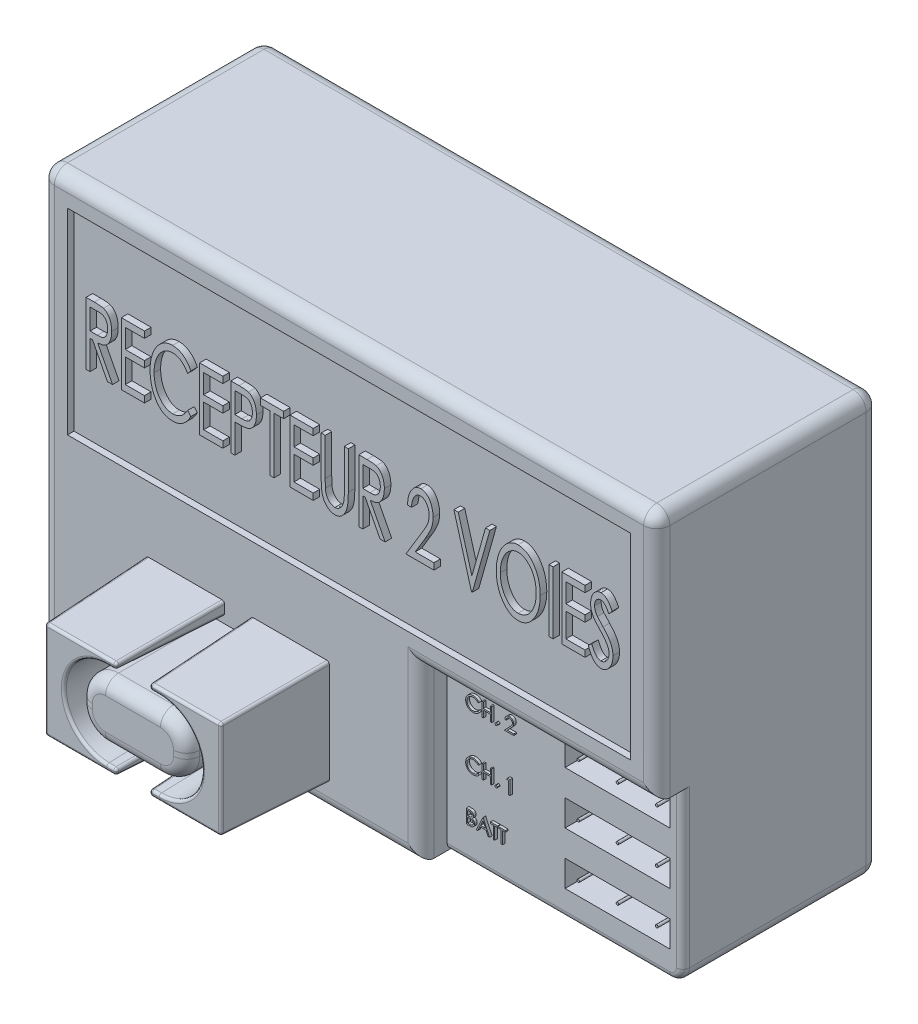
from build123d import *

# Parameters (mm, degrees)
ESQUISSE1_W                = 47
ESQUISSE1_H                = 32
EXTRUSION1_DEPTH           = 17
EXTRUSION2_DEPTH           = 8
EXTRUSION2_TAPER           = 2
CONG_2_R                   = 0.2
CONG_2_OF_SYM_TRIE1_R      = 0.2
ESQUISSE3_W                = 18
ESQUISSE3_H                = 13
ENL_V_MAT_EXTRU_1_DEPTH    = 2
ESQUISSE4_W                = 8
ESQUISSE4_H                = 2
ESQUISSE4_R                = 0.1
ENL_V_MAT_EXTRU_2_DEPTH    = 8
R_P_TITION_LIN_AIRE1_COUNT = 3
R_P_TITION_LIN_AIRE1_PITCH = 4
CONG_3_R                   = 1
CONG_4_R                   = 0.5
EXTRUSION3_DEPTH           = 0.2
ESQUISSE6_R                = 0.25
ENL_V_MAT_EXTRU_3_DEPTH    = 8
ESQUISSE7_W                = 43
ESQUISSE7_H                = 15
ENL_V_MAT_EXTRU_4_DEPTH    = 0.5
ESQUISSE8_W                = 0.305288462
ESQUISSE8_H                = 4.7625
EXTRUSION4_DEPTH           = 0.5
EXTRUSION5_DEPTH           = 16
CONG_5_R                   = 1


with BuildPart() as part:
    # Esquisse1 → Extrusion1 (new body)
    with BuildSketch(Plane.XY):
        Rectangle(ESQUISSE1_W, ESQUISSE1_H)
    extrude(amount=EXTRUSION1_DEPTH)

    # Esquisse2 → Extrusion2 (add)
    with BuildSketch(Plane.XY.offset(17)):
        with BuildLine():
            Line((-9.5, -6), (-15.5, -6))
            Line((-15.5, -6), (-15.5, -14))
            Line((-15.5, -14), (-9.5, -14))
            Line((-9.5, -14), (-9.5, -13))
            Line((-9.5, -13), (-10.5, -13))
            ThreePointArc((-10.5, -13), (-13.5, -10), (-10.5, -7))
            Line((-10.5, -7), (-9.5, -7))
            Line((-9.5, -7), (-9.5, -6))
        make_face()
    extrusion2 = extrude(amount=EXTRUSION2_DEPTH, taper=EXTRUSION2_TAPER)

    # Cong_2
    cong_2_edges = [part.edges().sort_by_distance(p)[0] for p in [
        (-9.639683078, -6.860316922, 21),
        (-9.639683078, -6.139683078, 21),
        (-15.360316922, -6.139683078, 21),
        (-15.360316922, -13.860316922, 21),
        (-9.639683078, -13.860316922, 21),
        (-9.639683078, -13.139683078, 21),
        (-9.779366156, -6.5, 25),
        (-12.5, -6.279366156, 25),
        (-15.220633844, -10, 25),
        (-12.5, -13.720633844, 25),
        (-9.779366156, -13.5, 25),
        (-10.139683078, -13.279366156, 25),
        (-13.779366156, -10, 25),
        (-10.139683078, -6.720633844, 25),
    ]]
    fillet(cong_2_edges, radius=CONG_2_R)

    # Sym_trie1: Extrusion2 across plane
    add(extrusion2.mirror(Plane.ZY.offset(8.5)))

    # Cong_2 of Sym_trie1
    cong_2_of_sym_trie1_edges = [part.edges().sort_by_distance(p)[0] for p in [
        (-7.360316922, -6.860316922, 21),
        (-7.360316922, -6.139683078, 21),
        (-1.639683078, -6.139683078, 21),
        (-1.639683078, -13.860316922, 21),
        (-7.360316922, -13.860316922, 21),
        (-7.360316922, -13.139683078, 21),
        (-7.220633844, -6.5, 25),
        (-4.5, -6.279366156, 25),
        (-1.779366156, -10, 25),
        (-4.5, -13.720633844, 25),
        (-7.220633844, -13.5, 25),
        (-6.860316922, -13.279366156, 25),
        (-3.220633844, -10, 25),
        (-6.860316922, -6.720633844, 25),
    ]]
    fillet(cong_2_of_sym_trie1_edges, radius=CONG_2_OF_SYM_TRIE1_R)

    # Esquisse3 → Enl_v. mat.-Extru.1 (cut)
    with BuildSketch(Plane.XY.offset(17)):
        with Locations((14.5, -9.5)):
            Rectangle(ESQUISSE3_W, ESQUISSE3_H)
    extrude(amount=-ENL_V_MAT_EXTRU_1_DEPTH, mode=Mode.SUBTRACT)

    # Esquisse4 → Enl_v. mat.-Extru.2 (cut)
    with BuildSketch(Plane.XY.offset(15)):
        with Locations((18.5, -5)):
            Rectangle(ESQUISSE4_W, ESQUISSE4_H)
        with Locations((21.5, -5)):
            Circle(ESQUISSE4_R, mode=Mode.SUBTRACT)
        with Locations((18.5, -5)):
            Circle(ESQUISSE4_R, mode=Mode.SUBTRACT)
        with Locations((15.5, -5)):
            Circle(ESQUISSE4_R, mode=Mode.SUBTRACT)
    enl_v_mat_extru_2 = extrude(amount=-ENL_V_MAT_EXTRU_2_DEPTH, mode=Mode.SUBTRACT)

    # R_p_tition lin_aire1: Enl_v. mat.-Extru.2 ×3
    with Locations(*[(0, -i * R_P_TITION_LIN_AIRE1_PITCH, 0) for i in range(1, R_P_TITION_LIN_AIRE1_COUNT)]):
        add(enl_v_mat_extru_2, mode=Mode.SUBTRACT)

    # Cong_3
    cong_3_edges = [part.edges().sort_by_distance(p)[0] for p in [
        (0, 16, 17),
        (23.5, 6.5, 17),
        (23.5, -16, 7.5),
        (14.5, -3, 17),
        (5.5, -9.5, 17),
        (-23.5, 0, 17),
        (0, 16, 0),
        (23.5, 0, 0),
        (0, -16, 0),
        (-23.5, 0, 0),
        (-9, -16, 17),
        (-23.5, 16, 8.5),
        (23.5, 16, 8.5),
        (-23.5, -16, 8.5),
    ]]
    fillet(cong_3_edges, radius=CONG_3_R)

    # Cong_4
    cong_4_edges = [part.edges().sort_by_distance(p)[0] for p in [
        (14, -16, 15),
        (23.5, -9, 15),
        (23.207106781, -15.707106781, 15),
    ]]
    fillet(cong_4_edges, radius=CONG_4_R)

    # Esquisse5 → Extrusion3 (add)
    # profile 1 of 12: a face of its own
    with BuildSketch(Plane.XY.offset(15)):
        with BuildLine():
            Line((8.142060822, -4.777760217), (8.058954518, -4.84136198))
            add(Edge.make_bspline(
                [(8.058954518, -4.84136198), (8.053026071, -4.834296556), (8.041249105, -4.820260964), (8.022302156, -4.800551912), (8.002556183, -4.78208694), (7.982018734, -4.764778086), (7.960320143, -4.749230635), (7.937986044, -4.734634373), (7.914642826, -4.721551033), (7.882363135, -4.705687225), (7.840136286, -4.689133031), (7.786979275, -4.675252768), (7.731489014, -4.666416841), (7.693631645, -4.665459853), (7.674375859, -4.664973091)],
                knots=[0, 0, 0, 0, 0.757959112, 1.505699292, 2.245454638, 2.979532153, 3.711538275, 4.438200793, 5.171680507, 5.909471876, 7.393775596, 8.890124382, 10.418191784, 12, 12, 12, 12], degree=3))
            add(Edge.make_bspline(
                [(7.674375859, -4.664973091), (7.663767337, -4.665095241), (7.642648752, -4.665338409), (7.611307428, -4.668546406), (7.580551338, -4.673055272), (7.55040049, -4.679745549), (7.520893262, -4.688203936), (7.49183675, -4.698311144), (7.46365164, -4.71081606), (7.43594803, -4.724637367), (7.409405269, -4.740248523), (7.384291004, -4.757276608), (7.360696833, -4.775531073), (7.338604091, -4.795080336), (7.317990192, -4.815836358), (7.299004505, -4.838020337), (7.281712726, -4.861561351), (7.265772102, -4.886148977), (7.251495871, -4.911711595), (7.239542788, -4.938343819), (7.228957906, -4.965589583), (7.220582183, -4.99375672), (7.213952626, -5.022647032), (7.209378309, -5.052338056), (7.206206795, -5.082767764), (7.205964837, -5.103392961), (7.205842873, -5.113789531)],
                knots=[0, 0, 0, 0, 1.054917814, 2.100044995, 3.131103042, 4.146048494, 5.169673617, 6.183595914, 7.203665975, 8.234915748, 9.262203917, 10.264457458, 11.251630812, 12.227803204, 13.197192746, 14.159520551, 15.12972552, 16.100847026, 17.073214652, 18.039054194, 19.002613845, 19.979014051, 20.95965708, 21.949030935, 22.966165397, 24, 24, 24, 24], degree=3))
            add(Edge.make_bspline(
                [(7.205842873, -5.113789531), (7.206224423, -5.129432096), (7.206973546, -5.160144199), (7.213640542, -5.205129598), (7.223771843, -5.248225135), (7.238956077, -5.289161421), (7.257679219, -5.328443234), (7.28133769, -5.365405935), (7.308738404, -5.400608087), (7.340269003, -5.43321774), (7.374863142, -5.463006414), (7.411979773, -5.489238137), (7.45152645, -5.51110478), (7.493066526, -5.52930084), (7.536919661, -5.543287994), (7.583006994, -5.553134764), (7.631228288, -5.559557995), (7.664178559, -5.560172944), (7.680948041, -5.560485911)],
                knots=[0, 0, 0, 0, 1.029171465, 2.020641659, 2.987623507, 3.938342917, 4.889210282, 5.84687017, 6.821220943, 7.821438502, 8.827599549, 9.822697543, 10.807740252, 11.797342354, 12.80366471, 13.83203677, 14.896651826, 16, 16, 16, 16], degree=3))
            add(Edge.make_bspline(
                [(7.680948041, -5.560485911), (7.69942433, -5.559975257), (7.735790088, -5.558970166), (7.789120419, -5.550455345), (7.840173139, -5.53664926), (7.888950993, -5.517327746), (7.935316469, -5.492210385), (7.979342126, -5.461761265), (8.021065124, -5.425690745), (8.04615406, -5.398148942), (8.058954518, -5.384097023)],
                knots=[0, 0, 0, 0, 1.028121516, 2.023589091, 2.998037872, 3.967518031, 4.937445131, 5.927275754, 6.942489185, 8, 8, 8, 8], degree=3))
            Line((8.058954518, -5.384097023), (8.142060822, -5.447062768))
            add(Edge.make_bspline(
                [(8.142060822, -5.447062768), (8.135372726, -5.455692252), (8.122028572, -5.472909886), (8.100421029, -5.497182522), (8.077658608, -5.520013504), (8.053572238, -5.541218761), (8.028439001, -5.561222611), (8.001807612, -5.579456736), (7.974028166, -5.596175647), (7.945194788, -5.611484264), (7.915338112, -5.625066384), (7.884493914, -5.636694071), (7.852795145, -5.646710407), (7.820240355, -5.654950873), (7.786762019, -5.661382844), (7.752480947, -5.665682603), (7.717323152, -5.668628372), (7.69360396, -5.668896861), (7.681584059, -5.66903292)],
                knots=[0, 0, 0, 0, 0.986787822, 1.968848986, 2.935600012, 3.899624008, 4.868462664, 5.837806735, 6.815139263, 7.798259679, 8.787526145, 9.778297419, 10.776456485, 11.791383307, 12.812564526, 13.85620153, 14.913611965, 16, 16, 16, 16], degree=3))
            add(Edge.make_bspline(
                [(7.681584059, -5.66903292), (7.670201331, -5.668953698), (7.647693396, -5.668797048), (7.614462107, -5.666259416), (7.582110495, -5.662797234), (7.550731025, -5.657584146), (7.520152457, -5.651432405), (7.490651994, -5.643186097), (7.461939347, -5.633948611), (7.434129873, -5.623091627), (7.407199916, -5.610840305), (7.381236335, -5.59699381), (7.356251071, -5.581668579), (7.331998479, -5.565202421), (7.308836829, -5.547066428), (7.286565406, -5.527512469), (7.265059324, -5.506606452), (7.25175375, -5.491531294), (7.24506396, -5.48395179)],
                knots=[0, 0, 0, 0, 1.114604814, 2.203992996, 3.262667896, 4.300477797, 5.318619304, 6.316056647, 7.298880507, 8.271930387, 9.238335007, 10.195173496, 11.151986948, 12.108099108, 13.064862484, 14.031167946, 15.010108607, 16, 16, 16, 16], degree=3))
            add(Edge.make_bspline(
                [(7.24506396, -5.48395179), (7.234348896, -5.470785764), (7.213048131, -5.444612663), (7.185795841, -5.402192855), (7.162467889, -5.357903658), (7.143606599, -5.311512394), (7.128861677, -5.26312316), (7.118646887, -5.212711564), (7.11200914, -5.160324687), (7.111250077, -5.124693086), (7.11086424, -5.106581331)],
                knots=[0, 0, 0, 0, 0.994628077, 1.977248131, 2.950237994, 3.925870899, 4.908910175, 5.911660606, 6.938484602, 8, 8, 8, 8], degree=3))
            add(Edge.make_bspline(
                [(7.11086424, -5.106581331), (7.111334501, -5.087544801), (7.11225971, -5.050091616), (7.120120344, -4.995126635), (7.132765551, -4.942466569), (7.150726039, -4.892209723), (7.173496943, -4.844091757), (7.201626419, -4.79848025), (7.234787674, -4.755083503), (7.272720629, -4.714559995), (7.314318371, -4.677506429), (7.358864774, -4.644907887), (7.406272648, -4.617779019), (7.456019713, -4.595101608), (7.508478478, -4.57767102), (7.563537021, -4.565468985), (7.621091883, -4.557874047), (7.660359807, -4.556913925), (7.680312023, -4.556426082)],
                knots=[0, 0, 0, 0, 1.032925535, 2.032216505, 3.007276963, 3.968222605, 4.92396291, 5.891752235, 6.871517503, 7.883894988, 8.900124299, 9.891468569, 10.874487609, 11.85992873, 12.854644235, 13.869047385, 14.917252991, 16, 16, 16, 16], degree=3))
            add(Edge.make_bspline(
                [(7.680312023, -4.556426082), (7.692472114, -4.556571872), (7.716541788, -4.556860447), (7.752147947, -4.559674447), (7.786813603, -4.564365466), (7.820562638, -4.570750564), (7.853559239, -4.578675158), (7.885551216, -4.588998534), (7.916726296, -4.600802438), (7.946887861, -4.614397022), (7.975891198, -4.629657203), (8.003727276, -4.646413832), (8.030174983, -4.664646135), (8.05542042, -4.684199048), (8.079041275, -4.705486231), (8.101708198, -4.727922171), (8.122651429, -4.752153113), (8.135579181, -4.769208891), (8.142060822, -4.777760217)],
                knots=[0, 0, 0, 0, 1.096760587, 2.17092713, 3.219439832, 4.250915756, 5.268269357, 6.278326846, 7.281116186, 8.274029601, 9.260640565, 10.235837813, 11.203064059, 12.156899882, 13.114053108, 14.069676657, 15.032185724, 16, 16, 16, 16], degree=3))
        make_face()
    # profile 2 of 12: a face of its own
    with BuildSketch(Plane.XY.offset(15)):
        Polygon((8.359154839, -4.583562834), (8.454133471, -4.583562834), (8.454133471, -5.017750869), (8.996868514, -5.017750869), (8.996868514, -4.583562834), (9.091847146, -4.583562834), (9.091847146, -5.641896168), (8.996868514, -5.641896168), (8.996868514, -5.126297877), (8.454133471, -5.126297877), (8.454133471, -5.641896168), (8.359154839, -5.641896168), align=None)
    # profile 3 of 12: a face of its own
    with BuildSketch(Plane.XY.offset(15)):
        with BuildLine():
            add(Edge.make_bspline(
                [(9.437840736, -5.479075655), (9.443734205, -5.479425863), (9.455287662, -5.480112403), (9.471990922, -5.484822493), (9.487108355, -5.493185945), (9.500574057, -5.504332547), (9.511673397, -5.517847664), (9.520334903, -5.532844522), (9.525003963, -5.549687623), (9.525685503, -5.561308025), (9.526035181, -5.567270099)],
                knots=[0, 0, 0, 0, 1.020151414, 1.999887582, 2.974338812, 3.990962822, 5.007586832, 5.987933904, 6.967670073, 8, 8, 8, 8], degree=3))
            add(Edge.make_bspline(
                [(9.526035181, -5.567270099), (9.525673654, -5.573088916), (9.524960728, -5.584563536), (9.520345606, -5.601279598), (9.511607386, -5.616285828), (9.500650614, -5.629984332), (9.487105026, -5.641154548), (9.471955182, -5.649446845), (9.455326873, -5.654494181), (9.443740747, -5.655137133), (9.437840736, -5.655464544)],
                knots=[0, 0, 0, 0, 1.009421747, 1.99056486, 2.972319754, 3.999869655, 5.017953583, 5.993804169, 6.978383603, 8, 8, 8, 8], degree=3))
            add(Edge.make_bspline(
                [(9.437840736, -5.655464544), (9.431936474, -5.65514898), (9.420409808, -5.654532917), (9.403843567, -5.649343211), (9.38860146, -5.641232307), (9.375058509, -5.629963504), (9.364009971, -5.616356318), (9.355656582, -5.601176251), (9.350640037, -5.584611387), (9.34998028, -5.573098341), (9.349646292, -5.567270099)],
                knots=[0, 0, 0, 0, 1.022052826, 1.995314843, 2.982371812, 4.00089066, 5.028879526, 6.005146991, 6.990147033, 8, 8, 8, 8], degree=3))
            add(Edge.make_bspline(
                [(9.349646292, -5.567270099), (9.34996745, -5.561298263), (9.350594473, -5.549638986), (9.355667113, -5.532947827), (9.363945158, -5.517777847), (9.375134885, -5.504353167), (9.388598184, -5.493108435), (9.403806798, -5.484924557), (9.420449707, -5.480074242), (9.431943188, -5.47941429), (9.437840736, -5.479075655)],
                knots=[0, 0, 0, 0, 1.032775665, 2.016367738, 2.991239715, 4.008302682, 5.025365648, 6.011011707, 6.979408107, 8, 8, 8, 8], degree=3))
        make_face()
    # profile 4 of 12: a face of its own
    with BuildSketch(Plane.XY.offset(15)):
        with BuildLine():
            Line((10.204453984, -4.90920386), (10.109475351, -4.90920386))
            add(Edge.make_bspline(
                [(10.109475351, -4.90920386), (10.110094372, -4.896603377), (10.111310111, -4.871856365), (10.117003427, -4.835775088), (10.125149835, -4.80128709), (10.136667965, -4.768669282), (10.150972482, -4.737633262), (10.168126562, -4.708302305), (10.188444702, -4.680788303), (10.211488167, -4.655346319), (10.236515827, -4.632006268), (10.263520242, -4.611850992), (10.291897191, -4.594821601), (10.321560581, -4.58058513), (10.352845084, -4.569899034), (10.385466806, -4.56197011), (10.419569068, -4.557199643), (10.442804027, -4.55668687), (10.454620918, -4.556426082)],
                knots=[0, 0, 0, 0, 1.10065271, 2.161652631, 3.183658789, 4.190468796, 5.17591951, 6.163126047, 7.15150782, 8.156236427, 9.156009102, 10.134482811, 11.092018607, 12.041330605, 13.001268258, 13.972401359, 14.968799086, 16, 16, 16, 16], degree=3))
            add(Edge.make_bspline(
                [(10.454620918, -4.556426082), (10.466225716, -4.556697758), (10.489028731, -4.557231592), (10.522309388, -4.561815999), (10.553992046, -4.568996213), (10.584014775, -4.579070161), (10.612138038, -4.592612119), (10.638573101, -4.60887947), (10.66363468, -4.627693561), (10.68619435, -4.649844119), (10.706909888, -4.673491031), (10.724781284, -4.698736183), (10.740085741, -4.724810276), (10.752842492, -4.751912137), (10.762233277, -4.780296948), (10.769362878, -4.809551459), (10.773392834, -4.839978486), (10.774011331, -4.860572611), (10.774325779, -4.871042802)],
                knots=[0, 0, 0, 0, 1.111607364, 2.184268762, 3.212621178, 4.221274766, 5.211760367, 6.196651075, 7.1921475, 8.207485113, 9.220403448, 10.201281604, 11.166441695, 12.114753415, 13.065576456, 14.026450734, 14.996634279, 16, 16, 16, 16], degree=3))
            add(Edge.make_bspline(
                [(10.774325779, -4.871042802), (10.773813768, -4.885783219), (10.772798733, -4.915005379), (10.764116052, -4.957947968), (10.750555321, -4.999553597), (10.734227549, -5.033038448), (10.71775612, -5.060020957), (10.702912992, -5.082236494), (10.685536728, -5.106156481), (10.66537442, -5.131700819), (10.642843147, -5.159069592), (10.617738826, -5.188246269), (10.58988244, -5.218929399), (10.570330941, -5.239886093), (10.560199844, -5.250745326)],
                knots=[0, 0, 0, 0, 1.184426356, 2.348067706, 3.509069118, 4.696110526, 5.333549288, 6.050745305, 6.844228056, 7.710549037, 8.667450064, 9.695053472, 10.805634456, 12, 12, 12, 12], degree=3))
            Line((10.560199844, -5.250745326), (10.295404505, -5.533349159))
            Line((10.295404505, -5.533349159), (10.787894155, -5.533349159))
            Line((10.787894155, -5.533349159), (10.787894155, -5.641896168))
            Line((10.787894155, -5.641896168), (10.068770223, -5.641896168))
            Line((10.068770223, -5.641896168), (10.479213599, -5.203892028))
            add(Edge.make_bspline(
                [(10.479213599, -5.203892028), (10.489206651, -5.193460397), (10.508401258, -5.173423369), (10.535549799, -5.144170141), (10.559933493, -5.117031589), (10.581710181, -5.09205899), (10.600407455, -5.068887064), (10.616999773, -5.048266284), (10.63029413, -5.029290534), (10.644722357, -5.007295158), (10.658696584, -4.980440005), (10.670704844, -4.947621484), (10.678026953, -4.913837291), (10.67890532, -4.891006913), (10.679347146, -4.879523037)],
                knots=[0, 0, 0, 0, 1.329631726, 2.553950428, 3.673215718, 4.687767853, 5.603093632, 6.413772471, 7.123043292, 7.734684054, 8.834405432, 9.900288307, 10.943827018, 12, 12, 12, 12], degree=3))
            add(Edge.make_bspline(
                [(10.679347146, -4.879523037), (10.67915491, -4.872301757), (10.678776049, -4.858070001), (10.675432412, -4.837203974), (10.670379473, -4.817076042), (10.663138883, -4.797624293), (10.653581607, -4.779044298), (10.64194799, -4.761313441), (10.62852528, -4.744171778), (10.612997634, -4.728099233), (10.595939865, -4.713378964), (10.577919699, -4.700339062), (10.558854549, -4.689441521), (10.538824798, -4.68050813), (10.517886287, -4.673500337), (10.495998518, -4.668644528), (10.473221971, -4.665595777), (10.457669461, -4.665183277), (10.449744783, -4.664973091)],
                knots=[0, 0, 0, 0, 0.991446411, 1.95395049, 2.89581595, 3.838931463, 4.798493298, 5.75982156, 6.748411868, 7.785213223, 8.824556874, 9.840280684, 10.836137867, 11.835679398, 12.848801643, 13.863922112, 14.911575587, 16, 16, 16, 16], degree=3))
            add(Edge.make_bspline(
                [(10.449744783, -4.664973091), (10.441468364, -4.665189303), (10.425214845, -4.665613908), (10.401351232, -4.668584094), (10.378586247, -4.673708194), (10.356862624, -4.680716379), (10.336143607, -4.689624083), (10.316529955, -4.700718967), (10.298065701, -4.713958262), (10.280716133, -4.728968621), (10.264731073, -4.74568049), (10.250686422, -4.76431017), (10.238414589, -4.784517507), (10.227707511, -4.806247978), (10.219012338, -4.829698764), (10.212368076, -4.854786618), (10.207110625, -4.881402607), (10.205354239, -4.899782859), (10.204453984, -4.90920386)],
                knots=[0, 0, 0, 0, 1.031018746, 2.02475058, 2.990194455, 3.934040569, 4.864654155, 5.795059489, 6.735614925, 7.690564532, 8.649604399, 9.611025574, 10.590972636, 11.591080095, 12.624614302, 13.701020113, 14.821632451, 16, 16, 16, 16], degree=3))
        make_face()
    # profile 5 of 12: a face of its own
    with BuildSketch(Plane.XY.offset(15)):
        with BuildLine():
            Line((8.142060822, -8.89996596), (8.058954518, -8.963567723))
            add(Edge.make_bspline(
                [(8.058954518, -8.963567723), (8.053026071, -8.956502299), (8.041249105, -8.942466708), (8.022302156, -8.922757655), (8.002556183, -8.904292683), (7.982018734, -8.886983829), (7.960320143, -8.871436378), (7.937986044, -8.856840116), (7.914642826, -8.843756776), (7.882363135, -8.827892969), (7.840136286, -8.811338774), (7.786979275, -8.797458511), (7.731489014, -8.788622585), (7.693631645, -8.787665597), (7.674375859, -8.787178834)],
                knots=[0, 0, 0, 0, 0.757959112, 1.505699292, 2.245454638, 2.979532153, 3.711538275, 4.438200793, 5.171680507, 5.909471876, 7.393775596, 8.890124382, 10.418191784, 12, 12, 12, 12], degree=3))
            add(Edge.make_bspline(
                [(7.674375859, -8.787178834), (7.663767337, -8.787300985), (7.642648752, -8.787544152), (7.611307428, -8.79075215), (7.580551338, -8.795261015), (7.55040049, -8.801951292), (7.520893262, -8.810409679), (7.49183675, -8.820516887), (7.46365164, -8.833021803), (7.43594803, -8.846843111), (7.409405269, -8.862454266), (7.384291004, -8.879482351), (7.360696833, -8.897736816), (7.338604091, -8.917286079), (7.317990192, -8.938042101), (7.299004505, -8.96022608), (7.281712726, -8.983767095), (7.265772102, -9.00835472), (7.251495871, -9.033917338), (7.239542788, -9.060549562), (7.228957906, -9.087795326), (7.220582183, -9.115962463), (7.213952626, -9.144852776), (7.209378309, -9.1745438), (7.206206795, -9.204973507), (7.205964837, -9.225598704), (7.205842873, -9.235995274)],
                knots=[0, 0, 0, 0, 1.054917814, 2.100044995, 3.131103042, 4.146048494, 5.169673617, 6.183595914, 7.203665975, 8.234915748, 9.262203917, 10.264457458, 11.251630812, 12.227803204, 13.197192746, 14.159520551, 15.12972552, 16.100847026, 17.073214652, 18.039054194, 19.002613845, 19.979014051, 20.95965708, 21.949030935, 22.966165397, 24, 24, 24, 24], degree=3))
            add(Edge.make_bspline(
                [(7.205842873, -9.235995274), (7.206224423, -9.25163784), (7.206973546, -9.282349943), (7.213640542, -9.327335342), (7.223771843, -9.370430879), (7.238956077, -9.411367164), (7.257679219, -9.450648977), (7.28133769, -9.487611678), (7.308738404, -9.52281383), (7.340269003, -9.555423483), (7.374863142, -9.585212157), (7.411979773, -9.611443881), (7.45152645, -9.633310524), (7.493066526, -9.651506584), (7.536919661, -9.665493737), (7.583006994, -9.675340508), (7.631228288, -9.681763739), (7.664178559, -9.682378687), (7.680948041, -9.682691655)],
                knots=[0, 0, 0, 0, 1.029171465, 2.020641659, 2.987623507, 3.938342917, 4.889210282, 5.84687017, 6.821220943, 7.821438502, 8.827599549, 9.822697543, 10.807740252, 11.797342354, 12.80366471, 13.83203677, 14.896651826, 16, 16, 16, 16], degree=3))
            add(Edge.make_bspline(
                [(7.680948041, -9.682691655), (7.69942433, -9.682181), (7.735790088, -9.681175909), (7.789120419, -9.672661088), (7.840173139, -9.658855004), (7.888950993, -9.639533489), (7.935316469, -9.614416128), (7.979342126, -9.583967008), (8.021065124, -9.547896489), (8.04615406, -9.520354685), (8.058954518, -9.506302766)],
                knots=[0, 0, 0, 0, 1.028121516, 2.023589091, 2.998037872, 3.967518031, 4.937445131, 5.927275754, 6.942489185, 8, 8, 8, 8], degree=3))
            Line((8.058954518, -9.506302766), (8.142060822, -9.569268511))
            add(Edge.make_bspline(
                [(8.142060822, -9.569268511), (8.135372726, -9.577897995), (8.122028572, -9.595115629), (8.100421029, -9.619388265), (8.077658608, -9.642219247), (8.053572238, -9.663424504), (8.028439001, -9.683428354), (8.001807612, -9.70166248), (7.974028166, -9.71838139), (7.945194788, -9.733690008), (7.915338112, -9.747272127), (7.884493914, -9.758899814), (7.852795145, -9.76891615), (7.820240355, -9.777156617), (7.786762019, -9.783588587), (7.752480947, -9.787888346), (7.717323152, -9.790834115), (7.69360396, -9.791102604), (7.681584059, -9.791238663)],
                knots=[0, 0, 0, 0, 0.986787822, 1.968848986, 2.935600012, 3.899624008, 4.868462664, 5.837806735, 6.815139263, 7.798259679, 8.787526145, 9.778297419, 10.776456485, 11.791383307, 12.812564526, 13.85620153, 14.913611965, 16, 16, 16, 16], degree=3))
            add(Edge.make_bspline(
                [(7.681584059, -9.791238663), (7.670201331, -9.791159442), (7.647693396, -9.791002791), (7.614462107, -9.788465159), (7.582110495, -9.785002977), (7.550731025, -9.77978989), (7.520152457, -9.773638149), (7.490651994, -9.76539184), (7.461939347, -9.756154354), (7.434129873, -9.74529737), (7.407199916, -9.733046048), (7.381236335, -9.719199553), (7.356251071, -9.703874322), (7.331998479, -9.687408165), (7.308836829, -9.669272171), (7.286565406, -9.649718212), (7.265059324, -9.628812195), (7.25175375, -9.613737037), (7.24506396, -9.606157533)],
                knots=[0, 0, 0, 0, 1.114604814, 2.203992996, 3.262667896, 4.300477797, 5.318619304, 6.316056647, 7.298880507, 8.271930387, 9.238335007, 10.195173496, 11.151986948, 12.108099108, 13.064862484, 14.031167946, 15.010108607, 16, 16, 16, 16], degree=3))
            add(Edge.make_bspline(
                [(7.24506396, -9.606157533), (7.234348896, -9.592991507), (7.213048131, -9.566818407), (7.185795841, -9.524398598), (7.162467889, -9.480109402), (7.143606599, -9.433718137), (7.128861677, -9.385328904), (7.118646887, -9.334917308), (7.11200914, -9.28253043), (7.111250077, -9.24689883), (7.11086424, -9.228787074)],
                knots=[0, 0, 0, 0, 0.994628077, 1.977248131, 2.950237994, 3.925870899, 4.908910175, 5.911660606, 6.938484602, 8, 8, 8, 8], degree=3))
            add(Edge.make_bspline(
                [(7.11086424, -9.228787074), (7.111334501, -9.209750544), (7.11225971, -9.17229736), (7.120120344, -9.117332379), (7.132765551, -9.064672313), (7.150726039, -9.014415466), (7.173496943, -8.9662975), (7.201626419, -8.920685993), (7.234787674, -8.877289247), (7.272720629, -8.836765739), (7.314318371, -8.799712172), (7.358864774, -8.76711363), (7.406272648, -8.739984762), (7.456019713, -8.717307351), (7.508478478, -8.699876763), (7.563537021, -8.687674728), (7.621091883, -8.680079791), (7.660359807, -8.679119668), (7.680312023, -8.678631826)],
                knots=[0, 0, 0, 0, 1.032925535, 2.032216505, 3.007276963, 3.968222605, 4.92396291, 5.891752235, 6.871517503, 7.883894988, 8.900124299, 9.891468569, 10.874487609, 11.85992873, 12.854644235, 13.869047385, 14.917252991, 16, 16, 16, 16], degree=3))
            add(Edge.make_bspline(
                [(7.680312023, -8.678631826), (7.692472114, -8.678777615), (7.716541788, -8.67906619), (7.752147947, -8.681880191), (7.786813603, -8.68657121), (7.820562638, -8.692956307), (7.853559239, -8.700880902), (7.885551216, -8.711204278), (7.916726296, -8.723008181), (7.946887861, -8.736602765), (7.975891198, -8.751862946), (8.003727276, -8.768619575), (8.030174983, -8.786851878), (8.05542042, -8.806404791), (8.079041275, -8.827691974), (8.101708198, -8.850127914), (8.122651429, -8.874358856), (8.135579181, -8.891414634), (8.142060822, -8.89996596)],
                knots=[0, 0, 0, 0, 1.096760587, 2.17092713, 3.219439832, 4.250915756, 5.268269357, 6.278326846, 7.281116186, 8.274029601, 9.260640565, 10.235837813, 11.203064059, 12.156899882, 13.114053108, 14.069676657, 15.032185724, 16, 16, 16, 16], degree=3))
        make_face()
    # profile 6 of 12: a face of its own
    with BuildSketch(Plane.XY.offset(15)):
        Polygon((8.359154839, -8.705768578), (8.454133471, -8.705768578), (8.454133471, -9.139956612), (8.996868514, -9.139956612), (8.996868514, -8.705768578), (9.091847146, -8.705768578), (9.091847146, -9.764101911), (8.996868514, -9.764101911), (8.996868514, -9.248503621), (8.454133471, -9.248503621), (8.454133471, -9.764101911), (8.359154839, -9.764101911), align=None)
    # profile 7 of 12: a face of its own
    with BuildSketch(Plane.XY.offset(15)):
        with BuildLine():
            add(Edge.make_bspline(
                [(9.437840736, -9.601281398), (9.443734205, -9.601631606), (9.455287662, -9.602318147), (9.471990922, -9.607028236), (9.487108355, -9.615391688), (9.500574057, -9.62653829), (9.511673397, -9.640053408), (9.520334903, -9.655050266), (9.525003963, -9.671893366), (9.525685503, -9.683513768), (9.526035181, -9.689475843)],
                knots=[0, 0, 0, 0, 1.020151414, 1.999887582, 2.974338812, 3.990962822, 5.007586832, 5.987933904, 6.967670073, 8, 8, 8, 8], degree=3))
            add(Edge.make_bspline(
                [(9.526035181, -9.689475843), (9.525673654, -9.695294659), (9.524960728, -9.70676928), (9.520345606, -9.723485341), (9.511607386, -9.738491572), (9.500650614, -9.752190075), (9.487105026, -9.763360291), (9.471955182, -9.771652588), (9.455326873, -9.776699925), (9.443740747, -9.777342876), (9.437840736, -9.777670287)],
                knots=[0, 0, 0, 0, 1.009421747, 1.99056486, 2.972319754, 3.999869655, 5.017953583, 5.993804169, 6.978383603, 8, 8, 8, 8], degree=3))
            add(Edge.make_bspline(
                [(9.437840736, -9.777670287), (9.431936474, -9.777354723), (9.420409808, -9.77673866), (9.403843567, -9.771548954), (9.38860146, -9.763438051), (9.375058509, -9.752169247), (9.364009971, -9.738562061), (9.355656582, -9.723381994), (9.350640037, -9.706817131), (9.34998028, -9.695304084), (9.349646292, -9.689475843)],
                knots=[0, 0, 0, 0, 1.022052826, 1.995314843, 2.982371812, 4.00089066, 5.028879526, 6.005146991, 6.990147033, 8, 8, 8, 8], degree=3))
            add(Edge.make_bspline(
                [(9.349646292, -9.689475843), (9.34996745, -9.683504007), (9.350594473, -9.671844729), (9.355667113, -9.65515357), (9.363945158, -9.63998359), (9.375134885, -9.62655891), (9.388598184, -9.615314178), (9.403806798, -9.6071303), (9.420449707, -9.602279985), (9.431943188, -9.601620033), (9.437840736, -9.601281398)],
                knots=[0, 0, 0, 0, 1.032775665, 2.016367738, 2.991239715, 4.008302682, 5.025365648, 6.011011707, 6.979408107, 8, 8, 8, 8], degree=3))
        make_face()
    # profile 8 of 12: a face of its own
    with BuildSketch(Plane.XY.offset(15)):
        Polygon((10.293708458, -8.705768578), (10.489389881, -8.705768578), (10.489389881, -9.764101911), (10.394411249, -9.764101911), (10.394411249, -8.814315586), (10.231590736, -8.814315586), align=None)
    # profile 9 of 12: a face of its own
    with BuildSketch(Plane.XY.offset(15)):
        with BuildLine():
            Line((7.165137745, -12.243301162), (7.371631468, -12.243301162))
            add(Edge.make_bspline(
                [(7.371631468, -12.243301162), (7.381739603, -12.243354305), (7.401331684, -12.243457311), (7.429821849, -12.245054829), (7.456506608, -12.247233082), (7.481393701, -12.250689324), (7.504471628, -12.254859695), (7.525809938, -12.259910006), (7.545340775, -12.265965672), (7.568658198, -12.275595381), (7.595243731, -12.289905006), (7.624029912, -12.311050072), (7.648645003, -12.336913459), (7.669868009, -12.366087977), (7.686741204, -12.398181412), (7.698948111, -12.432428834), (7.706676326, -12.468388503), (7.707471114, -12.493075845), (7.707872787, -12.50555243)],
                knots=[0, 0, 0, 0, 1.001505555, 1.941167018, 2.826882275, 3.653841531, 4.429895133, 5.150066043, 5.825578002, 6.45369114, 7.647487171, 8.808567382, 9.977351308, 11.170798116, 12.373658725, 13.556498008, 14.765093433, 16, 16, 16, 16], degree=3))
            add(Edge.make_bspline(
                [(7.707872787, -12.50555243), (7.707542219, -12.517240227), (7.706892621, -12.540207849), (7.700680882, -12.573800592), (7.690956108, -12.605777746), (7.677438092, -12.63602261), (7.659869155, -12.663851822), (7.639047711, -12.689489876), (7.613926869, -12.711851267), (7.595105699, -12.724352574), (7.585545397, -12.730702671)],
                knots=[0, 0, 0, 0, 1.044552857, 2.05264487, 3.044412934, 4.028983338, 5.005914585, 5.980388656, 6.974128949, 8, 8, 8, 8], degree=3))
            add(Edge.make_bspline(
                [(7.585545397, -12.730702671), (7.597568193, -12.735318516), (7.62057078, -12.74414977), (7.652225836, -12.759763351), (7.679499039, -12.776745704), (7.702600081, -12.795291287), (7.722356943, -12.815281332), (7.739608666, -12.83700895), (7.754328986, -12.860757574), (7.76694218, -12.886279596), (7.776784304, -12.913314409), (7.784155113, -12.941608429), (7.788378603, -12.971060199), (7.788979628, -12.991103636), (7.789283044, -13.001222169)],
                knots=[0, 0, 0, 0, 1.27268992, 2.434971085, 3.483601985, 4.442670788, 5.356604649, 6.2567628, 7.179492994, 8.113709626, 9.066344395, 10.018646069, 10.999752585, 12, 12, 12, 12], degree=3))
            add(Edge.make_bspline(
                [(7.789283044, -13.001222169), (7.788987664, -13.01155358), (7.788406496, -13.031880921), (7.784118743, -13.061742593), (7.776858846, -13.090279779), (7.766858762, -13.11767706), (7.7538073, -13.143881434), (7.737923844, -13.168922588), (7.718985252, -13.192548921), (7.697799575, -13.215022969), (7.673832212, -13.235230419), (7.647973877, -13.253226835), (7.619898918, -13.268027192), (7.590068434, -13.280459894), (7.558147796, -13.289956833), (7.524280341, -13.29660092), (7.488495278, -13.301077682), (7.463938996, -13.301445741), (7.451345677, -13.301634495)],
                knots=[0, 0, 0, 0, 0.978564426, 1.925352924, 2.850884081, 3.763762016, 4.682927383, 5.618979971, 6.567305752, 7.547517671, 8.540179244, 9.531824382, 10.526200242, 11.540722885, 12.589160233, 13.674978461, 14.80764778, 16, 16, 16, 16], degree=3))
            Line((7.451345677, -13.301634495), (7.165137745, -13.301634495))
            Line((7.165137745, -13.301634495), (7.165137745, -12.243301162))
        make_face()
        with BuildLine():
            Line((7.260116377, -12.35184817), (7.260116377, -12.691057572))
            Line((7.260116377, -12.691057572), (7.323930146, -12.691057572))
            add(Edge.make_bspline(
                [(7.323930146, -12.691057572), (7.333258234, -12.690936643), (7.351282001, -12.690702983), (7.377383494, -12.690033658), (7.401611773, -12.688159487), (7.423925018, -12.686285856), (7.44428809, -12.683239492), (7.462655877, -12.679613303), (7.479316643, -12.675778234), (7.498529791, -12.669256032), (7.520323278, -12.65961683), (7.543556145, -12.644657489), (7.564037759, -12.626839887), (7.581333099, -12.606280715), (7.595487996, -12.583642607), (7.605319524, -12.559286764), (7.611986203, -12.533820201), (7.612588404, -12.516337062), (7.612894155, -12.507460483)],
                knots=[0, 0, 0, 0, 1.156816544, 2.235205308, 3.236616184, 4.169592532, 5.011045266, 5.787822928, 6.49130361, 7.128639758, 8.301311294, 9.436451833, 10.541879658, 11.654887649, 12.756523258, 13.837046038, 14.901820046, 16, 16, 16, 16], degree=3))
            add(Edge.make_bspline(
                [(7.612894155, -12.507460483), (7.612735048, -12.5015865), (7.612422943, -12.49006404), (7.609866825, -12.473266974), (7.605522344, -12.457469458), (7.599942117, -12.442455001), (7.592144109, -12.428693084), (7.582962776, -12.41570788), (7.571869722, -12.403941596), (7.559243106, -12.392944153), (7.544726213, -12.383194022), (7.528327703, -12.374654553), (7.509825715, -12.367778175), (7.489532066, -12.36175591), (7.46713438, -12.357526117), (7.442891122, -12.354002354), (7.416603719, -12.352208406), (7.398416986, -12.351970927), (7.38901595, -12.35184817)],
                knots=[0, 0, 0, 0, 0.91205012, 1.789085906, 2.630437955, 3.453916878, 4.269457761, 5.079663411, 5.91843418, 6.774407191, 7.675494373, 8.627863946, 9.638891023, 10.736472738, 11.911756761, 13.175263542, 14.539845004, 16, 16, 16, 16], degree=3))
            Line((7.38901595, -12.35184817), (7.260116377, -12.35184817))
        make_face(mode=Mode.SUBTRACT)
        with BuildLine():
            Line((7.260116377, -12.79960458), (7.260116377, -13.193087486))
            Line((7.260116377, -13.193087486), (7.395376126, -13.193087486))
            add(Edge.make_bspline(
                [(7.395376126, -13.193087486), (7.405058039, -13.192971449), (7.423718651, -13.192747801), (7.450661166, -13.192017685), (7.475632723, -13.190356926), (7.498519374, -13.187742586), (7.519568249, -13.184906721), (7.53852684, -13.18109331), (7.555548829, -13.17672422), (7.575286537, -13.169970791), (7.597512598, -13.15947924), (7.621464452, -13.143660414), (7.642759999, -13.124815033), (7.66084397, -13.103004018), (7.675664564, -13.079287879), (7.686446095, -13.054146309), (7.693095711, -13.027994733), (7.6939007, -13.010164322), (7.694304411, -13.001222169)],
                knots=[0, 0, 0, 0, 1.160039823, 2.235823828, 3.228722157, 4.157150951, 4.99529583, 5.772374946, 6.472645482, 7.099169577, 8.269452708, 9.405989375, 10.527446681, 11.663510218, 12.788923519, 13.866172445, 14.929861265, 16, 16, 16, 16], degree=3))
            add(Edge.make_bspline(
                [(7.694304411, -13.001222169), (7.694220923, -12.995630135), (7.694055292, -12.984536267), (7.691557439, -12.96823315), (7.687924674, -12.952441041), (7.683228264, -12.937117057), (7.676388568, -12.922538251), (7.668403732, -12.908416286), (7.659041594, -12.894732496), (7.644453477, -12.8774326), (7.623234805, -12.857500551), (7.593085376, -12.83798564), (7.558803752, -12.822247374), (7.533939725, -12.815564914), (7.521095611, -12.812112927)],
                knots=[0, 0, 0, 0, 0.723448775, 1.435228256, 2.130040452, 2.821711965, 3.505591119, 4.210454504, 4.921174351, 5.648778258, 7.137944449, 8.670945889, 10.280296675, 12, 12, 12, 12], degree=3))
            add(Edge.make_bspline(
                [(7.521095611, -12.812112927), (7.515946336, -12.811068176), (7.504781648, -12.808802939), (7.486576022, -12.8064118), (7.465791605, -12.804281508), (7.442380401, -12.802705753), (7.416312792, -12.801076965), (7.387533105, -12.800443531), (7.356158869, -12.799687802), (7.334389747, -12.799633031), (7.323082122, -12.79960458)],
                knots=[0, 0, 0, 0, 0.634451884, 1.375622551, 2.216452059, 3.157844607, 4.20941857, 5.370758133, 6.634282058, 8, 8, 8, 8], degree=3))
            Line((7.323082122, -12.79960458), (7.260116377, -12.79960458))
        make_face(mode=Mode.SUBTRACT)
    # profile 10 of 12: a face of its own
    with BuildSketch(Plane.XY.offset(15)):
        Polygon((8.440565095, -12.243301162), (8.929026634, -13.301634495), (8.825779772, -13.301634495), (8.669319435, -12.962425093), (8.189550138, -12.962425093), (8.028637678, -13.301634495), (7.924966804, -13.301634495), (8.426996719, -12.243301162), align=None)
        Polygon((8.432720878, -12.449582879), (8.241067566, -12.853878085), (8.619286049, -12.853878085), align=None, mode=Mode.SUBTRACT)
    # profile 11 of 12: a face of its own
    with BuildSketch(Plane.XY.offset(15)):
        Polygon((8.996868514, -12.35184817), (8.996868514, -12.243301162), (9.553171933, -12.243301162), (9.553171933, -12.35184817), (9.32250954, -12.35184817), (9.32250954, -13.301634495), (9.227530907, -13.301634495), (9.227530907, -12.35184817), align=None)
    # profile 12 of 12: a face of its own
    with BuildSketch(Plane.XY.offset(15)):
        Polygon((9.593877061, -12.35184817), (9.593877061, -12.243301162), (10.15018048, -12.243301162), (10.15018048, -12.35184817), (9.919518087, -12.35184817), (9.919518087, -13.301634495), (9.824539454, -13.301634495), (9.824539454, -12.35184817), align=None)
    extrude(amount=EXTRUSION3_DEPTH)

    # Esquisse6 → Enl_v. mat.-Extru.3 (cut)
    with BuildSketch(Plane.XY.offset(17)):
        with BuildLine():
            Line((-10.5, -7.5), (-6.5, -7.5))
            ThreePointArc((-6.5, -7.5), (-4, -10), (-6.5, -12.5))
            Line((-6.5, -12.5), (-10.5, -12.5))
            ThreePointArc((-10.5, -12.5), (-13, -10), (-10.5, -7.5))
        make_face()
        with Locations((-10.5, -10)):
            Circle(ESQUISSE6_R, mode=Mode.SUBTRACT)
        with Locations((-6.5, -10)):
            Circle(ESQUISSE6_R, mode=Mode.SUBTRACT)
    extrude(amount=-ENL_V_MAT_EXTRU_3_DEPTH, mode=Mode.SUBTRACT)

    # Esquisse7 → Enl_v. mat.-Extru.4 (cut)
    with BuildSketch(Plane.XY.offset(17)):
        with Locations((0, 6.5)):
            Rectangle(ESQUISSE7_W, ESQUISSE7_H)
    extrude(amount=-ENL_V_MAT_EXTRU_4_DEPTH, mode=Mode.SUBTRACT)

    # Esquisse8 → Extrusion4 (add)
    # profile 1 of 15: a face of its own
    with BuildSketch(Plane.XY.offset(16.5)):
        with BuildLine():
            Line((-20.075850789, 8.811790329), (-19.453825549, 8.811790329))
            add(Edge.make_bspline(
                [(-19.453825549, 8.811790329), (-19.412166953, 8.811581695), (-19.332337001, 8.811181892), (-19.21778425, 8.808879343), (-19.113847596, 8.802433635), (-19.02017998, 8.796787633), (-18.9375678, 8.786686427), (-18.865131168, 8.776830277), (-18.803193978, 8.763918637), (-18.765901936, 8.752262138), (-18.748800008, 8.746916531)],
                knots=[0, 0, 0, 0, 1.407428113, 2.697040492, 3.869845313, 4.925382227, 5.866213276, 6.680589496, 7.394925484, 8, 8, 8, 8], degree=3))
            add(Edge.make_bspline(
                [(-18.748800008, 8.746916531), (-18.725979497, 8.738229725), (-18.680124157, 8.720774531), (-18.615335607, 8.684639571), (-18.553158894, 8.642823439), (-18.494382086, 8.59384065), (-18.440140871, 8.536928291), (-18.388587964, 8.473708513), (-18.339447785, 8.403935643), (-18.29563606, 8.326758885), (-18.253751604, 8.244866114), (-18.21942019, 8.15694708), (-18.187982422, 8.065314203), (-18.164827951, 7.968348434), (-18.1458729, 7.867409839), (-18.130939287, 7.76179487), (-18.123953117, 7.651472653), (-18.122660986, 7.576332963), (-18.122004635, 7.538165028)],
                knots=[0, 0, 0, 0, 0.808436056, 1.624464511, 2.451851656, 3.289979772, 4.154730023, 5.053627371, 5.992312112, 6.979461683, 7.992991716, 9.038256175, 10.104933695, 11.201707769, 12.338772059, 13.509016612, 14.734680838, 16, 16, 16, 16], degree=3))
            add(Edge.make_bspline(
                [(-18.122004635, 7.538165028), (-18.123492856, 7.474823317), (-18.126381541, 7.351875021), (-18.148050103, 7.173101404), (-18.186484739, 7.006411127), (-18.23832321, 6.8520731), (-18.3034829, 6.712091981), (-18.383007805, 6.589264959), (-18.476476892, 6.485100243), (-18.583444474, 6.397616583), (-18.708640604, 6.329346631), (-18.854248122, 6.28276966), (-19.020122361, 6.25280939), (-19.137898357, 6.249247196), (-19.200054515, 6.247367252)],
                knots=[0, 0, 0, 0, 1.188933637, 2.307758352, 3.373583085, 4.394893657, 5.35890623, 6.264613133, 7.131209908, 7.97589877, 8.846823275, 9.790718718, 10.834054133, 12, 12, 12, 12], degree=3))
            Line((-19.200054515, 6.247367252), (-18.060946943, 4.049290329))
            Line((-18.060946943, 4.049290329), (-18.447327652, 4.049290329))
            Line((-18.447327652, 4.049290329), (-19.586435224, 6.247367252))
            Line((-19.586435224, 6.247367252), (-19.770562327, 6.247367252))
            Line((-19.770562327, 6.247367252), (-19.770562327, 4.049290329))
            Line((-19.770562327, 4.049290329), (-20.075850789, 4.049290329))
            Line((-20.075850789, 4.049290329), (-20.075850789, 8.811790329))
        make_face()
        with BuildLine():
            Line((-19.770562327, 8.323328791), (-19.770562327, 6.735828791))
            Line((-19.770562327, 6.735828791), (-19.221997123, 6.729150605))
            add(Edge.make_bspline(
                [(-19.221997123, 6.729150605), (-19.17234151, 6.730182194), (-19.079722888, 6.732106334), (-18.950979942, 6.747577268), (-18.84237408, 6.774298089), (-18.751826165, 6.813990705), (-18.677265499, 6.86793621), (-18.611876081, 6.932862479), (-18.556990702, 7.012225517), (-18.51025008, 7.103032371), (-18.47443926, 7.20342033), (-18.445485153, 7.310034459), (-18.431106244, 7.422973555), (-18.428578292, 7.499973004), (-18.427293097, 7.539119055)],
                knots=[0, 0, 0, 0, 1.365533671, 2.547020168, 3.558986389, 4.432018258, 5.247504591, 6.07629865, 6.954834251, 7.889817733, 8.877758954, 9.881259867, 10.922845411, 12, 12, 12, 12], degree=3))
            add(Edge.make_bspline(
                [(-18.427293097, 7.539119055), (-18.428418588, 7.57734165), (-18.430633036, 7.6525461), (-18.447316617, 7.762496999), (-18.473542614, 7.867389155), (-18.512001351, 7.964958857), (-18.557422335, 8.053864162), (-18.611223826, 8.130831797), (-18.67253334, 8.193301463), (-18.742714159, 8.244390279), (-18.829138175, 8.281394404), (-18.935944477, 8.305509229), (-19.065045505, 8.321750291), (-19.158970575, 8.322775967), (-19.209594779, 8.323328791)],
                knots=[0, 0, 0, 0, 1.074408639, 2.113940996, 3.120290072, 4.108356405, 5.056275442, 5.922195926, 6.737902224, 7.507142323, 8.347902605, 9.360746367, 10.577481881, 12, 12, 12, 12], degree=3))
            Line((-19.209594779, 8.323328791), (-19.770562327, 8.323328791))
        make_face(mode=Mode.SUBTRACT)
    # profile 2 of 15: a face of its own
    with BuildSketch(Plane.XY.offset(16.5)):
        Polygon((-17.389312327, 8.811790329), (-15.61863925, 8.811790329), (-15.61863925, 8.323328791), (-17.084023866, 8.323328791), (-17.084023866, 6.857944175), (-15.61863925, 6.857944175), (-15.61863925, 6.369482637), (-17.084023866, 6.369482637), (-17.084023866, 4.537751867), (-15.61863925, 4.537751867), (-15.61863925, 4.049290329), (-17.389312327, 4.049290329), align=None)
    # profile 3 of 15: a face of its own
    with BuildSketch(Plane.XY.offset(16.5)):
        with BuildLine():
            Line((-12.077293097, 7.937902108), (-12.326293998, 7.651694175))
            add(Edge.make_bspline(
                [(-12.326293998, 7.651694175), (-12.36189602, 7.713569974), (-12.430922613, 7.833537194), (-12.552497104, 7.994696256), (-12.685178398, 8.13191808), (-12.827874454, 8.245224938), (-12.97927726, 8.335470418), (-13.139731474, 8.398664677), (-13.307293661, 8.438756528), (-13.421928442, 8.443202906), (-13.479711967, 8.445444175)],
                knots=[0, 0, 0, 0, 1.161547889, 2.252054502, 3.277362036, 4.261533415, 5.210870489, 6.135874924, 7.060357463, 8, 8, 8, 8], degree=3))
            add(Edge.make_bspline(
                [(-13.479711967, 8.445444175), (-13.511565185, 8.444875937), (-13.575241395, 8.443740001), (-13.669327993, 8.42945364), (-13.761967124, 8.408596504), (-13.852727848, 8.378983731), (-13.941453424, 8.340333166), (-14.02913523, 8.294730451), (-14.113619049, 8.238723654), (-14.196764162, 8.175960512), (-14.276317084, 8.105624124), (-14.351856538, 8.029129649), (-14.422658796, 7.946908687), (-14.488380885, 7.858571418), (-14.550781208, 7.765474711), (-14.606978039, 7.665244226), (-14.659216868, 7.559848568), (-14.723446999, 7.410909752), (-14.789718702, 7.213450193), (-14.84555089, 6.963441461), (-14.879566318, 6.699240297), (-14.883785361, 6.518414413), (-14.885946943, 6.425770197)],
                knots=[0, 0, 0, 0, 0.701353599, 1.402041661, 2.092242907, 2.792545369, 3.502009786, 4.22300985, 4.967468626, 5.732746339, 6.517259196, 7.305176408, 8.100260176, 8.906172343, 9.730282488, 10.568221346, 11.436356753, 12.321578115, 14.141010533, 16.016231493, 17.958958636, 20, 20, 20, 20], degree=3))
            add(Edge.make_bspline(
                [(-14.885946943, 6.425770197), (-14.884655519, 6.355444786), (-14.8821262, 6.217708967), (-14.862562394, 6.015644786), (-14.831473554, 5.822727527), (-14.787587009, 5.638257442), (-14.730461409, 5.462773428), (-14.660505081, 5.295927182), (-14.578518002, 5.1380587), (-14.48450948, 4.990982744), (-14.381382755, 4.856600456), (-14.270045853, 4.738923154), (-14.151428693, 4.639097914), (-14.026157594, 4.557692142), (-13.894233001, 4.493605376), (-13.755449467, 4.449098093), (-13.610368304, 4.419829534), (-13.51102097, 4.417047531), (-13.460631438, 4.415636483)],
                knots=[0, 0, 0, 0, 1.233743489, 2.416348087, 3.558399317, 4.660029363, 5.739909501, 6.792768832, 7.83097752, 8.857196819, 9.851614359, 10.798825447, 11.693988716, 12.565323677, 13.413831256, 14.259030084, 15.116970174, 16, 16, 16, 16], degree=3))
            add(Edge.make_bspline(
                [(-13.460631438, 4.415636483), (-13.405087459, 4.417970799), (-13.294951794, 4.422599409), (-13.133850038, 4.461294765), (-12.979993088, 4.524420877), (-12.833088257, 4.612176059), (-12.693789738, 4.725285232), (-12.563012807, 4.863921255), (-12.437079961, 5.025354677), (-12.364137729, 5.146522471), (-12.326293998, 5.209386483)],
                knots=[0, 0, 0, 0, 0.915631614, 1.815564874, 2.716965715, 3.651131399, 4.628852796, 5.668068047, 6.790152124, 8, 8, 8, 8], degree=3))
            Line((-12.326293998, 5.209386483), (-12.077293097, 4.926040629))
            add(Edge.make_bspline(
                [(-12.077293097, 4.926040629), (-12.097200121, 4.887315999), (-12.136611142, 4.810650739), (-12.202510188, 4.701761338), (-12.2712186, 4.598951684), (-12.34414213, 4.503295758), (-12.419979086, 4.413870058), (-12.499558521, 4.330881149), (-12.583659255, 4.256015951), (-12.670367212, 4.186689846), (-12.760749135, 4.125915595), (-12.853910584, 4.073030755), (-12.94960792, 4.028094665), (-13.048003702, 3.99057095), (-13.149237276, 3.961947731), (-13.25300606, 3.942172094), (-13.359166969, 3.92904237), (-13.43101693, 3.927801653), (-13.467309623, 3.927174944)],
                knots=[0, 0, 0, 0, 1.155425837, 2.287459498, 3.376082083, 4.436288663, 5.478192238, 6.487055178, 7.485268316, 8.464747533, 9.431634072, 10.372867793, 11.305546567, 12.235202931, 13.165089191, 14.093787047, 15.037137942, 16, 16, 16, 16], degree=3))
            add(Edge.make_bspline(
                [(-13.467309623, 3.927174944), (-13.50168978, 3.92752359), (-13.569665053, 3.928212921), (-13.670244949, 3.939808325), (-13.768277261, 3.955172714), (-13.863058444, 3.978726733), (-13.955571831, 4.006914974), (-14.044774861, 4.043667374), (-14.132089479, 4.085440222), (-14.216220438, 4.134360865), (-14.297502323, 4.189861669), (-14.375906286, 4.252059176), (-14.451124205, 4.320915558), (-14.523927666, 4.39588133), (-14.594732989, 4.476532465), (-14.661236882, 4.565225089), (-14.726565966, 4.659329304), (-14.766443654, 4.726083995), (-14.786728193, 4.760040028)],
                knots=[0, 0, 0, 0, 1.00462097, 1.986302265, 2.957000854, 3.90421223, 4.839435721, 5.782209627, 6.722090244, 7.667840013, 8.624678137, 9.597645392, 10.591537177, 11.604173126, 12.652097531, 13.727025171, 14.843808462, 16, 16, 16, 16], degree=3))
            add(Edge.make_bspline(
                [(-14.786728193, 4.760040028), (-14.819176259, 4.819665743), (-14.88459389, 4.939875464), (-14.965735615, 5.130503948), (-15.035771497, 5.329606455), (-15.093001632, 5.537737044), (-15.136669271, 5.755214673), (-15.167806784, 5.981426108), (-15.187381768, 6.216812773), (-15.189935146, 6.376758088), (-15.191235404, 6.458207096)],
                knots=[0, 0, 0, 0, 0.922384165, 1.859592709, 2.812582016, 3.790074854, 4.791378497, 5.825851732, 6.892857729, 8, 8, 8, 8], degree=3))
            add(Edge.make_bspline(
                [(-15.191235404, 6.458207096), (-15.189836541, 6.543806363), (-15.18709082, 6.711822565), (-15.163538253, 6.958491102), (-15.126161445, 7.194927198), (-15.071278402, 7.420497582), (-15.002598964, 7.636200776), (-14.919236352, 7.841957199), (-14.817765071, 8.03611544), (-14.704876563, 8.219504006), (-14.579190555, 8.38577204), (-14.445566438, 8.53288534), (-14.302063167, 8.655672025), (-14.152001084, 8.75816081), (-13.993146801, 8.837351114), (-13.826126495, 8.892862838), (-13.65157434, 8.92729939), (-13.532340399, 8.931687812), (-13.472079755, 8.933905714)],
                knots=[0, 0, 0, 0, 1.230206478, 2.414677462, 3.558482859, 4.668314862, 5.748220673, 6.810175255, 7.854920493, 8.893798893, 9.902220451, 10.846864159, 11.744795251, 12.6107401, 13.453002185, 14.287087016, 15.134296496, 16, 16, 16, 16], degree=3))
            add(Edge.make_bspline(
                [(-13.472079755, 8.933905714), (-13.435154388, 8.933269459), (-13.362358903, 8.932015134), (-13.254507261, 8.91909884), (-13.149621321, 8.898105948), (-13.047300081, 8.86928794), (-12.947249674, 8.833454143), (-12.850929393, 8.78667192), (-12.756487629, 8.733795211), (-12.66554501, 8.672136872), (-12.577950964, 8.603534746), (-12.493837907, 8.527960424), (-12.413919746, 8.446003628), (-12.337806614, 8.357623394), (-12.266849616, 8.262141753), (-12.198531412, 8.160562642), (-12.134763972, 8.052255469), (-12.096585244, 7.976288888), (-12.077293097, 7.937902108)],
                knots=[0, 0, 0, 0, 0.977726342, 1.927511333, 2.872465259, 3.808554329, 4.741264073, 5.683247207, 6.641363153, 7.606268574, 8.590360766, 9.5865286, 10.59919233, 11.620681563, 12.673640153, 13.748343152, 14.8622121, 16, 16, 16, 16], degree=3))
        make_face()
    # profile 4 of 15: a face of its own
    with BuildSketch(Plane.XY.offset(16.5)):
        Polygon((-11.405658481, 8.811790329), (-9.634985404, 8.811790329), (-9.634985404, 8.323328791), (-11.10037002, 8.323328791), (-11.10037002, 6.857944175), (-9.634985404, 6.857944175), (-9.634985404, 6.369482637), (-11.10037002, 6.369482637), (-11.10037002, 4.537751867), (-9.634985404, 4.537751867), (-9.634985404, 4.049290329), (-11.405658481, 4.049290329), align=None)
    # profile 5 of 15: a face of its own
    with BuildSketch(Plane.XY.offset(16.5)):
        with BuildLine():
            Line((-9.024408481, 8.811790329), (-8.401429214, 8.811790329))
            add(Edge.make_bspline(
                [(-8.401429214, 8.811790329), (-8.358493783, 8.811722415), (-8.276419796, 8.811592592), (-8.158741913, 8.807473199), (-8.051847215, 8.801994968), (-7.955783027, 8.794375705), (-7.870652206, 8.785531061), (-7.796917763, 8.772724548), (-7.733390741, 8.759515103), (-7.695665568, 8.746320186), (-7.678277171, 8.740238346)],
                knots=[0, 0, 0, 0, 1.41226677, 2.699643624, 3.872949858, 4.932814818, 5.869697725, 6.68658996, 7.394619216, 8, 8, 8, 8], degree=3))
            add(Edge.make_bspline(
                [(-7.678277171, 8.740238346), (-7.656460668, 8.731109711), (-7.612434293, 8.712687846), (-7.549624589, 8.677350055), (-7.490131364, 8.634817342), (-7.433576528, 8.586263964), (-7.381114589, 8.529921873), (-7.33027922, 8.468326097), (-7.283706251, 8.398958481), (-7.239979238, 8.323797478), (-7.199794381, 8.243103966), (-7.165559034, 8.156478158), (-7.136045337, 8.065385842), (-7.112154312, 7.968746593), (-7.09322401, 7.86747047), (-7.079836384, 7.760754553), (-7.07239834, 7.649257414), (-7.0711824, 7.573156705), (-7.070562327, 7.534348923)],
                knots=[0, 0, 0, 0, 0.79170105, 1.59767709, 2.407515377, 3.238240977, 4.089674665, 4.983053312, 5.910763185, 6.884540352, 7.894467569, 8.927005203, 10.001598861, 11.099590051, 12.259102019, 13.450850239, 14.700053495, 16, 16, 16, 16], degree=3))
            add(Edge.make_bspline(
                [(-7.070562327, 7.534348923), (-7.071176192, 7.495223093), (-7.072375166, 7.418804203), (-7.079858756, 7.306672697), (-7.093261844, 7.200020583), (-7.111440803, 7.098443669), (-7.133878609, 7.00200942), (-7.162659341, 6.910818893), (-7.196995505, 6.825144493), (-7.23593205, 6.744604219), (-7.280246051, 6.670581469), (-7.3264466, 6.601078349), (-7.378298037, 6.53910796), (-7.433717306, 6.483391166), (-7.49351139, 6.4342075), (-7.557194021, 6.39161297), (-7.624755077, 6.354476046), (-7.672334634, 6.335298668), (-7.696403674, 6.32559742)],
                knots=[0, 0, 0, 0, 1.294212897, 2.527801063, 3.71508936, 4.847866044, 5.939860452, 6.987801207, 8.007432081, 8.990656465, 9.943185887, 10.85929935, 11.748195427, 12.611004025, 13.455471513, 14.30444739, 15.142271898, 16, 16, 16, 16], degree=3))
            add(Edge.make_bspline(
                [(-7.696403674, 6.32559742), (-7.716040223, 6.319272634), (-7.758669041, 6.305542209), (-7.829820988, 6.289713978), (-7.91236781, 6.276748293), (-8.006641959, 6.266547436), (-8.112269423, 6.258153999), (-8.229629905, 6.251383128), (-8.35847344, 6.247662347), (-8.448174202, 6.247468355), (-8.494923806, 6.247367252)],
                knots=[0, 0, 0, 0, 0.614556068, 1.334134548, 2.169255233, 3.103849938, 4.159267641, 5.326845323, 6.606824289, 8, 8, 8, 8], degree=3))
            Line((-8.494923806, 6.247367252), (-8.71912002, 6.247367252))
            Line((-8.71912002, 6.247367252), (-8.71912002, 4.049290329))
            Line((-8.71912002, 4.049290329), (-9.024408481, 4.049290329))
            Line((-9.024408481, 4.049290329), (-9.024408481, 8.811790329))
        make_face()
        with BuildLine():
            Line((-8.71912002, 8.323328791), (-8.71912002, 6.735828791))
            Line((-8.71912002, 6.735828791), (-8.18009508, 6.7253345))
            add(Edge.make_bspline(
                [(-8.18009508, 6.7253345), (-8.129160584, 6.726325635), (-8.034309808, 6.728171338), (-7.902885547, 6.744038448), (-7.792556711, 6.769238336), (-7.701575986, 6.80802534), (-7.627388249, 6.861539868), (-7.562312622, 6.926170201), (-7.507532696, 7.005768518), (-7.45986935, 7.09629837), (-7.422414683, 7.196391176), (-7.395699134, 7.303630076), (-7.379228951, 7.416176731), (-7.376988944, 7.493269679), (-7.375850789, 7.53244087)],
                knots=[0, 0, 0, 0, 1.392812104, 2.593709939, 3.614865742, 4.479570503, 5.278455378, 6.102702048, 6.976417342, 7.910290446, 8.895848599, 9.891680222, 10.928755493, 12, 12, 12, 12], degree=3))
            add(Edge.make_bspline(
                [(-7.375850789, 7.53244087), (-7.37699326, 7.570660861), (-7.379250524, 7.646174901), (-7.395839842, 7.756775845), (-7.422297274, 7.862843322), (-7.460326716, 7.961840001), (-7.505985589, 8.051936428), (-7.559834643, 8.129728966), (-7.620850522, 8.193643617), (-7.692156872, 8.24405515), (-7.778590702, 8.281482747), (-7.884865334, 8.30529101), (-8.012943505, 8.321849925), (-8.10593155, 8.322809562), (-8.156244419, 8.323328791)],
                knots=[0, 0, 0, 0, 1.071153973, 2.116357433, 3.128295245, 4.130010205, 5.08297219, 5.953558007, 6.773169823, 7.547351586, 8.385564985, 9.395340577, 10.590701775, 12, 12, 12, 12], degree=3))
            Line((-8.156244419, 8.323328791), (-8.71912002, 8.323328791))
        make_face(mode=Mode.SUBTRACT)
    # profile 6 of 15: a face of its own
    with BuildSketch(Plane.XY.offset(16.5)):
        Polygon((-6.765273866, 8.323328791), (-6.765273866, 8.811790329), (-4.994600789, 8.811790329), (-4.994600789, 8.323328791), (-5.727293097, 8.323328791), (-5.727293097, 4.049290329), (-6.032581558, 4.049290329), (-6.032581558, 8.323328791), align=None)
    # profile 7 of 15: a face of its own
    with BuildSketch(Plane.XY.offset(16.5)):
        Polygon((-4.50613925, 8.811790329), (-2.735466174, 8.811790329), (-2.735466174, 8.323328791), (-4.200850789, 8.323328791), (-4.200850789, 6.857944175), (-2.735466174, 6.857944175), (-2.735466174, 6.369482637), (-4.200850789, 6.369482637), (-4.200850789, 4.537751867), (-2.735466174, 4.537751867), (-2.735466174, 4.049290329), (-4.50613925, 4.049290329), align=None)
    # profile 8 of 15: a face of its own
    with BuildSketch(Plane.XY.offset(16.5)):
        with BuildLine():
            Line((-2.12488925, 8.811790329), (-1.819600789, 8.811790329))
            Line((-1.819600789, 8.811790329), (-1.819600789, 5.95829724))
            add(Edge.make_bspline(
                [(-1.819600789, 5.95829724), (-1.819714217, 5.917909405), (-1.819929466, 5.841266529), (-1.818491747, 5.73219562), (-1.818254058, 5.63518504), (-1.815332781, 5.549990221), (-1.815634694, 5.476789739), (-1.812115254, 5.415447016), (-1.80960108, 5.366131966), (-1.807251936, 5.337222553), (-1.806244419, 5.324823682)],
                knots=[0, 0, 0, 0, 1.52940598, 2.902311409, 4.130712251, 5.202771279, 6.130127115, 6.901697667, 7.528952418, 8, 8, 8, 8], degree=3))
            add(Edge.make_bspline(
                [(-1.806244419, 5.324823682), (-1.801914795, 5.280197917), (-1.793547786, 5.193958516), (-1.769229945, 5.071299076), (-1.739138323, 4.959299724), (-1.70056319, 4.85775348), (-1.649389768, 4.766739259), (-1.589698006, 4.682424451), (-1.515553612, 4.608299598), (-1.434214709, 4.540871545), (-1.345472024, 4.486148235), (-1.254814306, 4.445674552), (-1.163369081, 4.419890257), (-1.102013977, 4.417044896), (-1.071644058, 4.415636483)],
                knots=[0, 0, 0, 0, 1.254096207, 2.423544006, 3.494494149, 4.497698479, 5.453764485, 6.40974764, 7.378978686, 8.378385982, 9.361411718, 10.285844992, 11.151517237, 12, 12, 12, 12], degree=3))
            add(Edge.make_bspline(
                [(-1.071644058, 4.415636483), (-1.045478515, 4.417087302), (-0.993170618, 4.419987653), (-0.915548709, 4.438460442), (-0.84092946, 4.471014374), (-0.767719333, 4.513662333), (-0.700117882, 4.569781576), (-0.635048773, 4.633428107), (-0.578401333, 4.708795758), (-0.52656972, 4.792367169), (-0.480142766, 4.885265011), (-0.443410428, 4.988542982), (-0.409769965, 5.100052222), (-0.394540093, 5.178369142), (-0.386653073, 5.218926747)],
                knots=[0, 0, 0, 0, 0.823211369, 1.645693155, 2.49286446, 3.37634291, 4.301154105, 5.248940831, 6.233287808, 7.257535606, 8.340102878, 9.49211773, 10.701255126, 12, 12, 12, 12], degree=3))
            add(Edge.make_bspline(
                [(-0.386653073, 5.218926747), (-0.383956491, 5.235760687), (-0.377920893, 5.273439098), (-0.371705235, 5.336512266), (-0.366190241, 5.41126948), (-0.361088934, 5.497764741), (-0.359105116, 5.596089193), (-0.35543046, 5.706410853), (-0.355311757, 5.82855279), (-0.354592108, 5.913777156), (-0.354216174, 5.95829724)],
                knots=[0, 0, 0, 0, 0.552277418, 1.236129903, 2.05245949, 2.981214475, 4.042936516, 5.238555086, 6.557457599, 8, 8, 8, 8], degree=3))
            Line((-0.354216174, 5.95829724), (-0.354216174, 8.811790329))
            Line((-0.354216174, 8.811790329), (-0.048927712, 8.811790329))
            Line((-0.048927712, 8.811790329), (-0.048927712, 5.935400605))
            add(Edge.make_bspline(
                [(-0.048927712, 5.935400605), (-0.049040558, 5.883563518), (-0.049260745, 5.782418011), (-0.053018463, 5.634181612), (-0.060067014, 5.493641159), (-0.067662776, 5.360544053), (-0.081215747, 5.235733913), (-0.093353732, 5.117767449), (-0.111132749, 5.00784591), (-0.135420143, 4.872467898), (-0.178375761, 4.713824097), (-0.249888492, 4.534624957), (-0.343605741, 4.368725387), (-0.436298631, 4.241271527), (-0.520245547, 4.150061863), (-0.587256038, 4.090888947), (-0.656885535, 4.039859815), (-0.730040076, 3.998140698), (-0.806885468, 3.966897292), (-0.886391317, 3.943588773), (-0.969420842, 3.930053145), (-1.025802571, 3.928145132), (-1.054471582, 3.927174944)],
                knots=[0, 0, 0, 0, 1.249413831, 2.437879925, 3.573563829, 4.64122582, 5.650269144, 6.59914801, 7.498925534, 8.333281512, 9.913771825, 11.450995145, 12.971250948, 14.49509659, 15.238124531, 15.954871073, 16.646334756, 17.315649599, 17.978968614, 18.641223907, 19.309088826, 20, 20, 20, 20], degree=3))
            add(Edge.make_bspline(
                [(-1.054471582, 3.927174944), (-1.085666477, 3.928248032), (-1.147028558, 3.930358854), (-1.237404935, 3.942374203), (-1.323660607, 3.96518315), (-1.407574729, 3.99423914), (-1.487306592, 4.034002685), (-1.564712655, 4.080548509), (-1.636848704, 4.137833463), (-1.706718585, 4.201284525), (-1.771204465, 4.27282448), (-1.830347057, 4.350670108), (-1.885267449, 4.433323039), (-1.932183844, 4.522805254), (-1.976313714, 4.616412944), (-2.011342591, 4.716920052), (-2.043762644, 4.822007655), (-2.05958998, 4.894737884), (-2.067647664, 4.931764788)],
                knots=[0, 0, 0, 0, 0.964904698, 1.898020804, 2.811448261, 3.719620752, 4.638746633, 5.561232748, 6.507315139, 7.481643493, 8.477128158, 9.480160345, 10.502905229, 11.541178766, 12.601567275, 13.699585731, 14.828860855, 16, 16, 16, 16], degree=3))
            add(Edge.make_bspline(
                [(-2.067647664, 4.931764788), (-2.07237117, 4.957163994), (-2.082663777, 5.012509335), (-2.093105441, 5.103387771), (-2.104248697, 5.207927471), (-2.110820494, 5.326704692), (-2.118284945, 5.458945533), (-2.121123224, 5.605303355), (-2.124523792, 5.76556837), (-2.124764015, 5.877202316), (-2.12488925, 5.935400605)],
                knots=[0, 0, 0, 0, 0.615833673, 1.341913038, 2.180168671, 3.122376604, 4.177705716, 5.338253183, 6.612347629, 8, 8, 8, 8], degree=3))
            Line((-2.12488925, 5.935400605), (-2.12488925, 8.811790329))
        make_face()
    # profile 9 of 15: a face of its own
    with BuildSketch(Plane.XY.offset(16.5)):
        with BuildLine():
            Line((0.744822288, 8.811790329), (1.366847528, 8.811790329))
            add(Edge.make_bspline(
                [(1.366847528, 8.811790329), (1.408506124, 8.811581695), (1.488336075, 8.811181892), (1.602888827, 8.808879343), (1.706825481, 8.802433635), (1.800493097, 8.796787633), (1.883105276, 8.786686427), (1.955541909, 8.776830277), (2.017479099, 8.763918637), (2.054771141, 8.752262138), (2.071873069, 8.746916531)],
                knots=[0, 0, 0, 0, 1.407428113, 2.697040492, 3.869845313, 4.925382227, 5.866213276, 6.680589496, 7.394925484, 8, 8, 8, 8], degree=3))
            add(Edge.make_bspline(
                [(2.071873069, 8.746916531), (2.09469358, 8.738229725), (2.14054892, 8.720774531), (2.20533747, 8.684639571), (2.267514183, 8.642823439), (2.326290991, 8.59384065), (2.380532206, 8.536928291), (2.432085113, 8.473708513), (2.481225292, 8.403935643), (2.525037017, 8.326758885), (2.566921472, 8.244866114), (2.601252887, 8.15694708), (2.632690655, 8.065314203), (2.655845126, 7.968348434), (2.674800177, 7.867409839), (2.68973379, 7.76179487), (2.69671996, 7.651472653), (2.698012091, 7.576332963), (2.698668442, 7.538165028)],
                knots=[0, 0, 0, 0, 0.808436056, 1.624464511, 2.451851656, 3.289979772, 4.154730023, 5.053627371, 5.992312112, 6.979461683, 7.992991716, 9.038256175, 10.104933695, 11.201707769, 12.338772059, 13.509016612, 14.734680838, 16, 16, 16, 16], degree=3))
            add(Edge.make_bspline(
                [(2.698668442, 7.538165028), (2.697180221, 7.474823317), (2.694291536, 7.351875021), (2.672622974, 7.173101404), (2.634188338, 7.006411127), (2.582349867, 6.8520731), (2.517190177, 6.712091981), (2.437665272, 6.589264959), (2.344196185, 6.485100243), (2.237228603, 6.397616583), (2.112032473, 6.329346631), (1.966424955, 6.28276966), (1.800550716, 6.25280939), (1.68277472, 6.249247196), (1.620618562, 6.247367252)],
                knots=[0, 0, 0, 0, 1.188933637, 2.307758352, 3.373583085, 4.394893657, 5.35890623, 6.264613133, 7.131209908, 7.97589877, 8.846823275, 9.790718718, 10.834054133, 12, 12, 12, 12], degree=3))
            Line((1.620618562, 6.247367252), (2.759726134, 4.049290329))
            Line((2.759726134, 4.049290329), (2.373345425, 4.049290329))
            Line((2.373345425, 4.049290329), (1.234237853, 6.247367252))
            Line((1.234237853, 6.247367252), (1.05011075, 6.247367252))
            Line((1.05011075, 6.247367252), (1.05011075, 4.049290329))
            Line((1.05011075, 4.049290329), (0.744822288, 4.049290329))
            Line((0.744822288, 4.049290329), (0.744822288, 8.811790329))
        make_face()
        with BuildLine():
            Line((1.05011075, 8.323328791), (1.05011075, 6.735828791))
            Line((1.05011075, 6.735828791), (1.598675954, 6.729150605))
            add(Edge.make_bspline(
                [(1.598675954, 6.729150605), (1.648331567, 6.730182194), (1.740950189, 6.732106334), (1.869693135, 6.747577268), (1.978298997, 6.774298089), (2.068846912, 6.813990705), (2.143407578, 6.86793621), (2.208796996, 6.932862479), (2.263682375, 7.012225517), (2.310422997, 7.103032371), (2.346233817, 7.20342033), (2.375187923, 7.310034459), (2.389566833, 7.422973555), (2.392094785, 7.499973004), (2.39337998, 7.539119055)],
                knots=[0, 0, 0, 0, 1.365533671, 2.547020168, 3.558986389, 4.432018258, 5.247504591, 6.07629865, 6.954834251, 7.889817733, 8.877758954, 9.881259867, 10.922845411, 12, 12, 12, 12], degree=3))
            add(Edge.make_bspline(
                [(2.39337998, 7.539119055), (2.392254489, 7.57734165), (2.390040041, 7.6525461), (2.37335646, 7.762496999), (2.347130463, 7.867389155), (2.308671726, 7.964958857), (2.263250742, 8.053864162), (2.209449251, 8.130831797), (2.148139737, 8.193301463), (2.077958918, 8.244390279), (1.991534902, 8.281394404), (1.8847286, 8.305509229), (1.755627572, 8.321750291), (1.661702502, 8.322775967), (1.611078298, 8.323328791)],
                knots=[0, 0, 0, 0, 1.074408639, 2.113940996, 3.120290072, 4.108356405, 5.056275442, 5.922195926, 6.737902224, 7.507142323, 8.347902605, 9.360746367, 10.577481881, 12, 12, 12, 12], degree=3))
            Line((1.611078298, 8.323328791), (1.05011075, 8.323328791))
        make_face(mode=Mode.SUBTRACT)
    # profile 10 of 15: a face of its own
    with BuildSketch(Plane.XY.offset(16.5)):
        with BuildLine():
            Line((4.77462998, 7.346405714), (4.469341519, 7.346405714))
            add(Edge.make_bspline(
                [(4.469341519, 7.346405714), (4.471206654, 7.403054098), (4.474860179, 7.514019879), (4.491682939, 7.676062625), (4.514863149, 7.830784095), (4.548231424, 7.977411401), (4.590464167, 8.116672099), (4.640588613, 8.248308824), (4.700080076, 8.372050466), (4.767346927, 8.486979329), (4.840948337, 8.591160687), (4.91920021, 8.682936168), (5.00288877, 8.760023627), (5.090590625, 8.823306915), (5.18257844, 8.872963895), (5.278786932, 8.908631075), (5.379784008, 8.930351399), (5.448702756, 8.932713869), (5.483471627, 8.933905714)],
                knots=[0, 0, 0, 0, 1.310522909, 2.567119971, 3.765476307, 4.927040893, 6.041545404, 7.128826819, 8.181526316, 9.213386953, 10.205203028, 11.128226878, 11.997525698, 12.830306, 13.623357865, 14.407595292, 15.196646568, 16, 16, 16, 16], degree=3))
            add(Edge.make_bspline(
                [(5.483471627, 8.933905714), (5.517587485, 8.932623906), (5.585147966, 8.930085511), (5.683668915, 8.909870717), (5.776601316, 8.875353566), (5.865519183, 8.830019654), (5.947495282, 8.768041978), (6.02691567, 8.695995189), (6.097695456, 8.607344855), (6.164857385, 8.509235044), (6.225582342, 8.402015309), (6.277530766, 8.28835863), (6.322915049, 8.170266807), (6.359891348, 8.047515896), (6.388879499, 7.919711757), (6.40817436, 7.787307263), (6.421406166, 7.650054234), (6.422586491, 7.556960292), (6.423187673, 7.509544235)],
                knots=[0, 0, 0, 0, 0.867581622, 1.718093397, 2.544835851, 3.384424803, 4.246974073, 5.151569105, 6.105683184, 7.124531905, 8.175264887, 9.235950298, 10.30131595, 11.39170386, 12.494835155, 13.632238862, 14.794015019, 16, 16, 16, 16], degree=3))
            add(Edge.make_bspline(
                [(6.423187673, 7.509544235), (6.421863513, 7.443001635), (6.419250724, 7.311701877), (6.394207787, 7.118060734), (6.355749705, 6.930504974), (6.308741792, 6.777721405), (6.261208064, 6.65446381), (6.219310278, 6.5540564), (6.169199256, 6.446101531), (6.112102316, 6.329916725), (6.047111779, 6.205906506), (5.974356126, 6.074540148), (5.895125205, 5.934761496), (5.83884397, 5.839589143), (5.80974867, 5.790388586)],
                knots=[0, 0, 0, 0, 1.293342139, 2.551981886, 3.790222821, 5.012738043, 5.654713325, 6.358706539, 7.127901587, 7.968613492, 8.875829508, 9.850033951, 10.888547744, 12, 12, 12, 12], degree=3))
            Line((5.80974867, 5.790388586), (5.054159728, 4.537751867))
            Line((5.054159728, 4.537751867), (6.484245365, 4.537751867))
            Line((6.484245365, 4.537751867), (6.484245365, 4.049290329))
            Line((6.484245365, 4.049290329), (4.347226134, 4.049290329))
            Line((4.347226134, 4.049290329), (5.537851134, 6.020308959))
            add(Edge.make_bspline(
                [(5.537851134, 6.020308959), (5.566952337, 6.067275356), (5.622941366, 6.157635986), (5.701094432, 6.28954916), (5.771668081, 6.411682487), (5.835301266, 6.524069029), (5.889030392, 6.627966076), (5.936548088, 6.721746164), (5.975527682, 6.806458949), (6.017893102, 6.906560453), (6.058112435, 7.028131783), (6.092287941, 7.175332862), (6.114458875, 7.326335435), (6.116743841, 7.42837443), (6.117899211, 7.479969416)],
                knots=[0, 0, 0, 0, 1.24808666, 2.401246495, 3.463368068, 4.434631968, 5.31825823, 6.105358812, 6.809289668, 7.42432652, 8.560171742, 9.696289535, 10.835152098, 12, 12, 12, 12], degree=3))
            add(Edge.make_bspline(
                [(6.117899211, 7.479969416), (6.115930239, 7.543746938), (6.112107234, 7.667578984), (6.075838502, 7.846393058), (6.016521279, 8.011547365), (5.947362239, 8.13695947), (5.882286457, 8.226132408), (5.832049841, 8.285102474), (5.778046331, 8.334246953), (5.721429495, 8.374711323), (5.662013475, 8.406870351), (5.599426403, 8.428520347), (5.534659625, 8.442635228), (5.490541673, 8.444500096), (5.468207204, 8.445444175)],
                knots=[0, 0, 0, 0, 1.789189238, 3.473934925, 5.098217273, 6.701075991, 7.474478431, 8.196088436, 8.872464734, 9.519188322, 10.14638177, 10.762090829, 11.373315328, 12, 12, 12, 12], degree=3))
            add(Edge.make_bspline(
                [(5.468207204, 8.445444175), (5.444938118, 8.444439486), (5.398655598, 8.442441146), (5.330702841, 8.429121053), (5.266070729, 8.405653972), (5.204526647, 8.37387098), (5.145754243, 8.333322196), (5.090097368, 8.283478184), (5.03895828, 8.223212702), (4.989235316, 8.156186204), (4.944592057, 8.080252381), (4.904271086, 7.997141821), (4.870465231, 7.906174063), (4.840794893, 7.808378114), (4.815864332, 7.703295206), (4.797407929, 7.590699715), (4.782796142, 7.471026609), (4.77740388, 7.388737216), (4.77462998, 7.346405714)],
                knots=[0, 0, 0, 0, 0.780692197, 1.552807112, 2.312136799, 3.080408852, 3.870594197, 4.701713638, 5.578944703, 6.517913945, 7.498688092, 8.529433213, 9.61336398, 10.750795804, 11.956770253, 13.233717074, 14.576962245, 16, 16, 16, 16], degree=3))
        make_face()
    # profile 11 of 15: a face of its own
    with BuildSketch(Plane.XY.offset(16.5)):
        Polygon((8.010687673, 8.811790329), (8.341734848, 8.811790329), (9.38448575, 5.112075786), (10.427236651, 8.811790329), (10.758283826, 8.811790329), (9.415014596, 4.049290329), (9.353956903, 4.049290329), align=None)
    # profile 12 of 15: a face of its own
    with BuildSketch(Plane.XY.offset(16.5)):
        with BuildLine():
            add(Edge.make_bspline(
                [(12.904843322, 8.933905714), (12.964136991, 8.931657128), (13.081140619, 8.927220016), (13.252987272, 8.89332147), (13.416230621, 8.834636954), (13.573673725, 8.756457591), (13.721822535, 8.652663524), (13.863105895, 8.527644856), (13.995850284, 8.379065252), (14.120316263, 8.21052646), (14.233621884, 8.025892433), (14.333668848, 7.82923764), (14.417218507, 7.621883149), (14.486353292, 7.404114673), (14.539376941, 7.175966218), (14.577409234, 6.937210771), (14.600697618, 6.688274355), (14.603495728, 6.518679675), (14.604918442, 6.432448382)],
                knots=[0, 0, 0, 0, 0.850545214, 1.678372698, 2.501039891, 3.333683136, 4.193166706, 5.08866264, 6.035343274, 7.046593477, 8.091438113, 9.140420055, 10.208991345, 11.295726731, 12.415902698, 13.566741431, 14.762797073, 16, 16, 16, 16], degree=3))
            add(Edge.make_bspline(
                [(14.604918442, 6.432448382), (14.603493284, 6.346853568), (14.600690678, 6.178529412), (14.577414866, 5.931171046), (14.539121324, 5.693821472), (14.487234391, 5.465841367), (14.418463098, 5.247974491), (14.333896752, 5.04032054), (14.236111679, 4.841740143), (14.121998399, 4.656686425), (13.99889978, 4.486692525), (13.86657576, 4.337796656), (13.728472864, 4.210352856), (13.581873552, 4.107467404), (13.429536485, 4.025642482), (13.26914077, 3.969627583), (13.102667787, 3.933467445), (12.988985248, 3.929286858), (12.931556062, 3.927174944)],
                knots=[0, 0, 0, 0, 1.236115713, 2.430849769, 3.584683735, 4.706674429, 5.804899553, 6.880462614, 7.942454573, 8.998050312, 10.016890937, 10.970119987, 11.870772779, 12.724575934, 13.550546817, 14.35974471, 15.171389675, 16, 16, 16, 16], degree=3))
            add(Edge.make_bspline(
                [(12.931556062, 3.927174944), (12.873494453, 3.929289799), (12.758558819, 3.933476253), (12.590171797, 3.969589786), (12.42837215, 4.025589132), (12.274147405, 4.106537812), (12.126584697, 4.209201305), (11.986618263, 4.335480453), (11.855172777, 4.485095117), (11.730294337, 4.653342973), (11.617168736, 4.838091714), (11.517004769, 5.03424392), (11.434842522, 5.241052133), (11.365513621, 5.456343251), (11.312252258, 5.681267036), (11.274399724, 5.915599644), (11.250936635, 6.159435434), (11.248158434, 6.325226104), (11.246745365, 6.409551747)],
                knots=[0, 0, 0, 0, 0.840727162, 1.664258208, 2.484998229, 3.315823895, 4.180188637, 5.084342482, 6.040928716, 7.062380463, 8.117765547, 9.177329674, 10.25068005, 11.339594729, 12.453127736, 13.597375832, 14.77796002, 16, 16, 16, 16], degree=3))
            add(Edge.make_bspline(
                [(11.246745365, 6.409551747), (11.247537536, 6.466173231), (11.249109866, 6.578557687), (11.259898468, 6.745659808), (11.277054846, 6.90988247), (11.300475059, 7.071093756), (11.332354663, 7.228880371), (11.370550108, 7.38357057), (11.414939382, 7.535386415), (11.46778003, 7.682795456), (11.525239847, 7.824968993), (11.588191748, 7.960229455), (11.656985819, 8.086648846), (11.729493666, 8.205926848), (11.807794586, 8.316959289), (11.892039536, 8.419557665), (11.979493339, 8.515960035), (12.07328958, 8.602313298), (12.16949894, 8.680314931), (12.268860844, 8.747764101), (12.369830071, 8.805273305), (12.473038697, 8.852004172), (12.577946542, 8.889070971), (12.685157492, 8.914189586), (12.794237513, 8.931722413), (12.867884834, 8.933176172), (12.904843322, 8.933905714)],
                knots=[0, 0, 0, 0, 1.225901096, 2.433214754, 3.623961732, 4.800248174, 5.958829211, 7.10775404, 8.249351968, 9.381776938, 10.496714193, 11.568641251, 12.609968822, 13.611354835, 14.589461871, 15.548677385, 16.48427412, 17.405084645, 18.306197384, 19.163664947, 20.002321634, 20.818895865, 21.613698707, 22.406949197, 23.200558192, 24, 24, 24, 24], degree=3))
        make_face()
        with BuildLine():
            add(Edge.make_bspline(
                [(12.919153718, 8.445444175), (12.889201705, 8.444899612), (12.82962429, 8.443816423), (12.741296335, 8.429236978), (12.654027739, 8.408557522), (12.567551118, 8.378932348), (12.482884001, 8.339091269), (12.398550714, 8.292656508), (12.316238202, 8.236631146), (12.235772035, 8.172986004), (12.157445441, 8.102475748), (12.083247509, 8.025257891), (12.013406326, 7.942092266), (11.948569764, 7.852845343), (11.887367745, 7.758471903), (11.830773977, 7.657874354), (11.779722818, 7.550758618), (11.715695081, 7.400319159), (11.649086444, 7.201043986), (11.593813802, 6.949334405), (11.558146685, 6.684691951), (11.554099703, 6.503800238), (11.552033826, 6.4114598)],
                knots=[0, 0, 0, 0, 0.665200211, 1.323146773, 1.985070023, 2.65807727, 3.350884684, 4.063012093, 4.796406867, 5.561623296, 6.342552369, 7.137596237, 7.940554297, 8.755101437, 9.588575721, 10.440116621, 11.319212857, 12.225302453, 14.074304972, 15.979982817, 17.947887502, 20, 20, 20, 20], degree=3))
            add(Edge.make_bspline(
                [(11.552033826, 6.4114598), (11.553448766, 6.342735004), (11.556224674, 6.207906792), (11.574114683, 6.009839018), (11.605805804, 5.820201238), (11.64957411, 5.638379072), (11.705844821, 5.464488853), (11.774308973, 5.298479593), (11.857316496, 5.141850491), (11.949441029, 4.993779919), (12.051554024, 4.859505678), (12.159453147, 4.741244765), (12.272483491, 4.640651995), (12.391856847, 4.558923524), (12.515886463, 4.494110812), (12.645826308, 4.449247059), (12.780453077, 4.419870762), (12.872569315, 4.41705862), (12.919153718, 4.415636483)],
                knots=[0, 0, 0, 0, 1.235427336, 2.423731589, 3.571225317, 4.688752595, 5.782471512, 6.853668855, 7.912268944, 8.965421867, 9.985281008, 10.940102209, 11.83925887, 12.698666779, 13.534713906, 14.346486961, 15.163796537, 16, 16, 16, 16], degree=3))
            add(Edge.make_bspline(
                [(12.919153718, 4.415636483), (12.950362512, 4.416281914), (13.012396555, 4.417564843), (13.104677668, 4.430631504), (13.195185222, 4.45121171), (13.283638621, 4.481563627), (13.370433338, 4.518743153), (13.456170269, 4.563520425), (13.538759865, 4.618543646), (13.619995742, 4.680369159), (13.697649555, 4.749744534), (13.771585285, 4.825626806), (13.841054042, 4.907561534), (13.906051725, 4.995541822), (13.966347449, 5.089694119), (14.022500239, 5.189666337), (14.074291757, 5.295994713), (14.136420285, 5.447134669), (14.203352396, 5.646049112), (14.259112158, 5.897357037), (14.293187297, 6.161201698), (14.297452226, 6.341393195), (14.29962998, 6.433402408)],
                knots=[0, 0, 0, 0, 0.692377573, 1.376246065, 2.064617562, 2.749941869, 3.448838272, 4.159331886, 4.893556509, 5.648923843, 6.423926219, 7.202681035, 7.998995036, 8.806587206, 9.629006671, 10.479222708, 11.350597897, 12.252547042, 14.105368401, 16.001193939, 17.958133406, 20, 20, 20, 20], degree=3))
            add(Edge.make_bspline(
                [(14.29962998, 6.433402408), (14.297442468, 6.524774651), (14.293158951, 6.70369684), (14.259311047, 6.965050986), (14.20336835, 7.21319395), (14.136317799, 7.408843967), (14.074302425, 7.557963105), (14.021350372, 7.662585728), (13.965293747, 7.762309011), (13.904151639, 7.856050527), (13.838107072, 7.943663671), (13.768494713, 8.026617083), (13.692900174, 8.102477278), (13.613991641, 8.173005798), (13.532440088, 8.236966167), (13.448459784, 8.292395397), (13.363062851, 8.339120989), (13.277168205, 8.379143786), (13.189016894, 8.408542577), (13.099860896, 8.429247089), (13.009941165, 8.443764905), (12.949421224, 8.444884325), (12.919153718, 8.445444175)],
                knots=[0, 0, 0, 0, 2.036905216, 3.988602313, 5.865316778, 7.699607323, 8.592542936, 9.464624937, 10.312500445, 11.142484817, 11.957953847, 12.75785906, 13.555119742, 14.34362881, 15.116681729, 15.8640378, 16.584467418, 17.285763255, 17.974178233, 18.651845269, 19.325754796, 20, 20, 20, 20], degree=3))
        make_face(mode=Mode.SUBTRACT)
    # profile 13 of 15: a face of its own
    with BuildSketch(Plane.XY.offset(16.5)):
        with Locations((15.429197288, 6.430540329)):
            Rectangle(ESQUISSE8_W, ESQUISSE8_H)
    # profile 14 of 15: a face of its own
    with BuildSketch(Plane.XY.offset(16.5)):
        Polygon((16.253476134, 8.811790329), (18.024149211, 8.811790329), (18.024149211, 8.323328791), (16.558764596, 8.323328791), (16.558764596, 6.857944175), (18.024149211, 6.857944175), (18.024149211, 6.369482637), (16.558764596, 6.369482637), (16.558764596, 4.537751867), (18.024149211, 4.537751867), (18.024149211, 4.049290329), (16.253476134, 4.049290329), align=None)
    # profile 15 of 15: a face of its own
    with BuildSketch(Plane.XY.offset(16.5)):
        with BuildLine():
            Line((18.26837998, 4.968017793), (18.536461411, 5.209386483))
            add(Edge.make_bspline(
                [(18.536461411, 5.209386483), (18.56145434, 5.147048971), (18.608732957, 5.029126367), (18.687489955, 4.866750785), (18.770184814, 4.729425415), (18.855772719, 4.616305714), (18.94475222, 4.527373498), (19.037487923, 4.463565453), (19.134338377, 4.423017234), (19.201063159, 4.41806851), (19.23385474, 4.415636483)],
                knots=[0, 0, 0, 0, 1.444141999, 2.731854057, 3.876652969, 4.88620636, 5.776102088, 6.569016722, 7.296749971, 8, 8, 8, 8], degree=3))
            add(Edge.make_bspline(
                [(19.23385474, 4.415636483), (19.261661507, 4.416837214), (19.31744063, 4.419245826), (19.399196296, 4.441594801), (19.478621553, 4.476105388), (19.553304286, 4.525251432), (19.623239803, 4.584994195), (19.684032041, 4.656353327), (19.737403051, 4.736037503), (19.779495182, 4.825200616), (19.813555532, 4.919814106), (19.838524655, 5.018169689), (19.853206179, 5.119579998), (19.854980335, 5.188031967), (19.85587998, 5.222742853)],
                knots=[0, 0, 0, 0, 0.884972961, 1.775215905, 2.683238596, 3.636659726, 4.614356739, 5.606354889, 6.615919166, 7.663465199, 8.741100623, 9.818211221, 10.893650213, 12, 12, 12, 12], degree=3))
            add(Edge.make_bspline(
                [(19.85587998, 5.222742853), (19.854216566, 5.262256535), (19.850867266, 5.34181772), (19.829679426, 5.460232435), (19.792899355, 5.5773594), (19.758164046, 5.652089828), (19.740442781, 5.69021581)],
                knots=[0, 0, 0, 0, 0.976256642, 1.965702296, 2.962141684, 4, 4, 4, 4], degree=3))
            add(Edge.make_bspline(
                [(19.740442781, 5.69021581), (19.726149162, 5.717436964), (19.69638259, 5.774125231), (19.643216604, 5.858591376), (19.582886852, 5.947771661), (19.514492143, 6.040726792), (19.43746409, 6.137489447), (19.352751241, 6.238532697), (19.259196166, 6.34320841), (19.193297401, 6.413504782), (19.159440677, 6.449620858)],
                knots=[0, 0, 0, 0, 0.768999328, 1.601447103, 2.495214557, 3.462788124, 4.487959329, 5.58922734, 6.761420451, 8, 8, 8, 8], degree=3))
            add(Edge.make_bspline(
                [(19.159440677, 6.449620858), (19.125523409, 6.48536425), (19.060445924, 6.553945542), (18.970433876, 6.65531491), (18.88892812, 6.747820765), (18.817221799, 6.832381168), (18.756266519, 6.909494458), (18.705051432, 6.978638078), (18.663766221, 7.039819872), (18.641807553, 7.079456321), (18.631864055, 7.097404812)],
                knots=[0, 0, 0, 0, 1.412183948, 2.709574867, 3.885118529, 4.945948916, 5.886880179, 6.701763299, 7.412122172, 8, 8, 8, 8], degree=3))
            add(Edge.make_bspline(
                [(18.631864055, 7.097404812), (18.603868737, 7.153665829), (18.548051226, 7.265839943), (18.493008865, 7.445786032), (18.458041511, 7.631880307), (18.453734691, 7.758384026), (18.451553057, 7.822464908)],
                knots=[0, 0, 0, 0, 0.997886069, 1.989601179, 2.981625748, 4, 4, 4, 4], degree=3))
            add(Edge.make_bspline(
                [(18.451553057, 7.822464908), (18.45286554, 7.87277245), (18.455450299, 7.971846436), (18.474932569, 8.116846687), (18.506085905, 8.255387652), (18.55075354, 8.38550475), (18.606810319, 8.505906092), (18.673027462, 8.614102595), (18.750729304, 8.708514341), (18.837792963, 8.788201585), (18.932583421, 8.852569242), (19.031914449, 8.900363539), (19.13666327, 8.928052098), (19.207622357, 8.931943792), (19.243395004, 8.933905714)],
                knots=[0, 0, 0, 0, 1.198175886, 2.359647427, 3.478865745, 4.576151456, 5.630190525, 6.637223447, 7.589778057, 8.533585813, 9.439222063, 10.310193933, 11.148117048, 12, 12, 12, 12], degree=3))
            add(Edge.make_bspline(
                [(19.243395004, 8.933905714), (19.281470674, 8.931966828), (19.357753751, 8.92808235), (19.469531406, 8.893613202), (19.576434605, 8.837952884), (19.661408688, 8.77515939), (19.727386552, 8.712520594), (19.77910922, 8.655840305), (19.831225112, 8.590083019), (19.883840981, 8.515071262), (19.936902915, 8.431105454), (19.991425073, 8.338263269), (20.046672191, 8.236537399), (20.081924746, 8.16477433), (20.10011075, 8.12775337)],
                knots=[0, 0, 0, 0, 1.101491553, 2.206794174, 3.356881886, 4.582769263, 5.254341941, 5.991524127, 6.804811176, 7.684485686, 8.645879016, 9.682856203, 10.804637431, 12, 12, 12, 12], degree=3))
            Line((20.10011075, 8.12775337), (19.84252361, 7.834867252))
            add(Edge.make_bspline(
                [(19.84252361, 7.834867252), (19.827208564, 7.864905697), (19.797790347, 7.922605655), (19.751230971, 8.003260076), (19.709135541, 8.077316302), (19.666726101, 8.142113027), (19.626872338, 8.199571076), (19.588700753, 8.24925521), (19.552945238, 8.291551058), (19.507433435, 8.335596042), (19.450504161, 8.379663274), (19.37770644, 8.417986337), (19.301040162, 8.440819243), (19.248629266, 8.443901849), (19.222406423, 8.445444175)],
                knots=[0, 0, 0, 0, 1.323957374, 2.543150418, 3.657038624, 4.668619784, 5.583350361, 6.402729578, 7.128847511, 7.75594525, 8.88754786, 9.943344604, 10.970989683, 12, 12, 12, 12], degree=3))
            add(Edge.make_bspline(
                [(19.222406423, 8.445444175), (19.189292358, 8.443800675), (19.124711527, 8.440595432), (19.033836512, 8.40398401), (18.951806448, 8.349014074), (18.883190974, 8.271509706), (18.827264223, 8.179884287), (18.785558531, 8.076566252), (18.761923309, 7.962489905), (18.758570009, 7.883312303), (18.756841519, 7.842499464)],
                knots=[0, 0, 0, 0, 0.932400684, 1.818417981, 2.732166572, 3.707006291, 4.721275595, 5.759272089, 6.84499573, 8, 8, 8, 8], degree=3))
            add(Edge.make_bspline(
                [(18.756841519, 7.842499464), (18.75905564, 7.791754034), (18.763479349, 7.690367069), (18.793254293, 7.565245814), (18.829816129, 7.466006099), (18.867749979, 7.38889798), (18.913664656, 7.308086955), (18.949796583, 7.254889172), (18.968635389, 7.227152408)],
                knots=[0, 0, 0, 0, 1.378874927, 2.754926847, 3.4745486, 4.251965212, 5.088593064, 6, 6, 6, 6], degree=3))
            add(Edge.make_bspline(
                [(18.968635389, 7.227152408), (18.975504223, 7.217827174), (18.991870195, 7.195608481), (19.023875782, 7.160270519), (19.06428569, 7.114839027), (19.113461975, 7.06002976), (19.171661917, 6.995518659), (19.240811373, 6.923715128), (19.317902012, 6.84119564), (19.372776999, 6.783485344), (19.401763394, 6.753001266)],
                knots=[0, 0, 0, 0, 0.432455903, 1.030387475, 1.779234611, 2.704692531, 3.781171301, 5.024938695, 6.428495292, 8, 8, 8, 8], degree=3))
            add(Edge.make_bspline(
                [(19.401763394, 6.753001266), (19.436918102, 6.715319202), (19.505275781, 6.642047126), (19.602065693, 6.532556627), (19.688916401, 6.425104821), (19.76809391, 6.321581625), (19.83903142, 6.221210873), (19.90150947, 6.12418801), (19.953923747, 6.029153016), (20.013313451, 5.908679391), (20.071407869, 5.758820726), (20.124513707, 5.578858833), (20.154415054, 5.397374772), (20.158926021, 5.276267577), (20.161168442, 5.216064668)],
                knots=[0, 0, 0, 0, 1.054312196, 2.050090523, 2.988961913, 3.880306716, 4.716041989, 5.502944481, 6.239760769, 6.935172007, 8.249640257, 9.522223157, 10.768286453, 12, 12, 12, 12], degree=3))
            add(Edge.make_bspline(
                [(20.161168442, 5.216064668), (20.160522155, 5.173420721), (20.159246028, 5.089217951), (20.146529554, 4.965174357), (20.125692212, 4.845229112), (20.095746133, 4.729635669), (20.058941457, 4.617736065), (20.01296257, 4.510493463), (19.958141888, 4.407887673), (19.896042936, 4.310825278), (19.828028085, 4.221514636), (19.755657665, 4.143077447), (19.679988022, 4.076199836), (19.599997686, 4.022282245), (19.516386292, 3.979828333), (19.42894587, 3.948970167), (19.337689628, 3.930220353), (19.275600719, 3.928194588), (19.244349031, 3.927174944)],
                knots=[0, 0, 0, 0, 1.172407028, 2.314980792, 3.424959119, 4.51733058, 5.595891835, 6.66154085, 7.72179341, 8.791632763, 9.827142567, 10.804909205, 11.722218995, 12.597852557, 13.450474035, 14.294077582, 15.141344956, 16, 16, 16, 16], degree=3))
            add(Edge.make_bspline(
                [(19.244349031, 3.927174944), (19.220126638, 3.927877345), (19.171729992, 3.929280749), (19.100287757, 3.941586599), (19.030064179, 3.958760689), (18.962740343, 3.98705306), (18.895963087, 4.019519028), (18.831667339, 4.061286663), (18.769439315, 4.110503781), (18.708065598, 4.166842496), (18.648339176, 4.232578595), (18.590620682, 4.308292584), (18.53289124, 4.393260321), (18.478415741, 4.489406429), (18.422445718, 4.594122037), (18.369543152, 4.709666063), (18.318034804, 4.835312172), (18.285311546, 4.922767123), (18.26837998, 4.968017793)],
                knots=[0, 0, 0, 0, 0.762723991, 1.523932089, 2.279910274, 3.035489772, 3.819833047, 4.617697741, 5.445709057, 6.31808117, 7.240320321, 8.240611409, 9.316328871, 10.474896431, 11.721171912, 13.057405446, 14.477451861, 16, 16, 16, 16], degree=3))
        make_face()
    extrude(amount=EXTRUSION4_DEPTH)

    # Esquisse9 → Extrusion5 (add)
    with BuildSketch(Plane.XY.offset(9)):
        with BuildLine():
            Line((-10.6, -7.8), (-6.4, -7.8))
            ThreePointArc((-6.4, -7.8), (-4.985786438, -8.385786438), (-4.4, -9.8))
            Line((-4.4, -9.8), (-4.4, -10.2))
            ThreePointArc((-4.4, -10.2), (-4.985786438, -11.614213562), (-6.4, -12.2))
            Line((-6.4, -12.2), (-10.6, -12.2))
            ThreePointArc((-10.6, -12.2), (-12.014213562, -11.614213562), (-12.6, -10.2))
            Line((-12.6, -10.2), (-12.6, -9.8))
            ThreePointArc((-12.6, -9.8), (-12.014213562, -8.385786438), (-10.6, -7.8))
        make_face()
    extrude(amount=EXTRUSION5_DEPTH)

    # Cong_5
    cong_5_edges = [part.edges().sort_by_distance(p)[0] for p in [
        (-4.985786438, -8.385786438, 25),
        (-8.5, -7.8, 25),
        (-12.014213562, -8.385786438, 25),
        (-12.6, -10, 25),
        (-12.014213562, -11.614213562, 25),
        (-8.5, -12.2, 25),
        (-4.985786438, -11.614213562, 25),
        (-4.4, -10, 25),
    ]]
    fillet(cong_5_edges, radius=CONG_5_R)


solid = part.part
